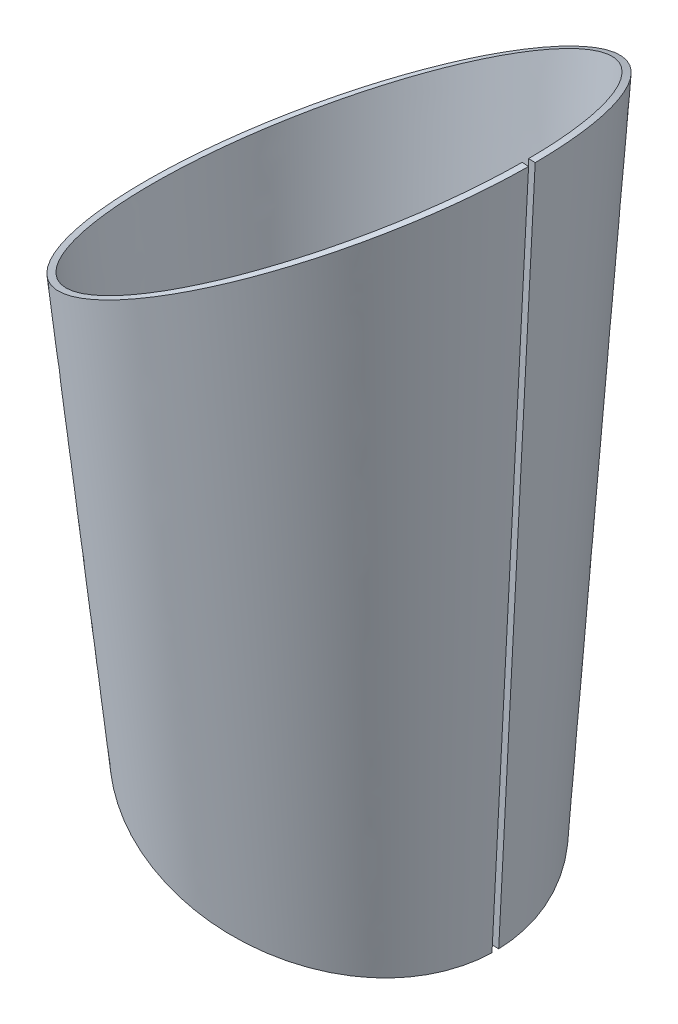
ISO-10303-21;
HEADER;
FILE_DESCRIPTION(('STEP AP214'),'2;1');
FILE_NAME('part.step','',(''),(''),'','','');
FILE_SCHEMA(('AUTOMOTIVE_DESIGN { 1 0 10303 214 1 1 1 1 }'));
ENDSEC;
DATA;
#1=APPLICATION_CONTEXT('core data for automotive mechanical design processes');
#2=APPLICATION_PROTOCOL_DEFINITION('international standard','automotive_design',2000,#1);
#3=PRODUCT_CONTEXT('',#1,'mechanical');
#4=PRODUCT('Part','Part','',(#3));
#5=PRODUCT_RELATED_PRODUCT_CATEGORY('part','',(#4));
#6=PRODUCT_DEFINITION_FORMATION('','',#4);
#7=PRODUCT_DEFINITION_CONTEXT('part definition',#1,'design');
#8=PRODUCT_DEFINITION('design','',#6,#7);
#9=PRODUCT_DEFINITION_SHAPE('','',#8);
#10=(LENGTH_UNIT() NAMED_UNIT(*) SI_UNIT(.MILLI.,.METRE.));
#11=(NAMED_UNIT(*) PLANE_ANGLE_UNIT() SI_UNIT($,.RADIAN.));
#12=(NAMED_UNIT(*) SI_UNIT($,.STERADIAN.) SOLID_ANGLE_UNIT());
#13=UNCERTAINTY_MEASURE_WITH_UNIT(LENGTH_MEASURE(1.E-05),#10,'distance_accuracy_value','');
#14=(GEOMETRIC_REPRESENTATION_CONTEXT(3) GLOBAL_UNCERTAINTY_ASSIGNED_CONTEXT((#13)) GLOBAL_UNIT_ASSIGNED_CONTEXT((#10,
#11,#12)) REPRESENTATION_CONTEXT('',''));
#15=CARTESIAN_POINT('',(0.,0.,0.));
#16=DIRECTION('',(0.,0.,1.));
#17=DIRECTION('',(1.,0.,0.));
#18=AXIS2_PLACEMENT_3D('',#15,#16,#17);
#19=CARTESIAN_POINT('',(14.9302857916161,49.4498078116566,-0.256418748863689));
#20=CARTESIAN_POINT('',(14.8687812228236,49.4164323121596,-4.89962809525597));
#21=CARTESIAN_POINT('',(13.1747422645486,48.4970121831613,-9.08992767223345));
#22=CARTESIAN_POINT('',(9.11277967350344,46.3049031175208,-13.6353972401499));
#23=CARTESIAN_POINT('',(7.50455396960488,45.4386921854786,-14.8608833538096));
#24=CARTESIAN_POINT('',(3.933050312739,43.5217069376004,-16.5488710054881));
#25=CARTESIAN_POINT('',(1.96910320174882,42.470965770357,-17.0106807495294));
#26=CARTESIAN_POINT('',(-2.14311954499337,40.2718441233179,-16.9827369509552));
#27=CARTESIAN_POINT('',(-4.10516676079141,39.2257627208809,-16.4942500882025));
#28=CARTESIAN_POINT('',(-7.66605333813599,37.325102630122,-14.7525920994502));
#29=CARTESIAN_POINT('',(-9.26515057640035,36.4704695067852,-13.5003353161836));
#30=CARTESIAN_POINT('',(-13.2846676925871,34.3190225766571,-8.88166121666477));
#31=CARTESIAN_POINT('',(-14.9302782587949,33.434502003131,-4.65256872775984));
#32=CARTESIAN_POINT('',(-14.9302782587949,33.434502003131,4.65256872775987));
#33=CARTESIAN_POINT('',(-13.2846676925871,34.3190225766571,8.8816612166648));
#34=CARTESIAN_POINT('',(-9.26515057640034,36.4704695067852,13.5003353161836));
#35=CARTESIAN_POINT('',(-7.66605333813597,37.325102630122,14.7525920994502));
#36=CARTESIAN_POINT('',(-4.10516676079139,39.2257627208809,16.4942500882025));
#37=CARTESIAN_POINT('',(-2.14311954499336,40.271844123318,16.9827369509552));
#38=CARTESIAN_POINT('',(1.96910320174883,42.470965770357,17.0106807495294));
#39=CARTESIAN_POINT('',(3.93305031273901,43.5217069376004,16.5488710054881));
#40=CARTESIAN_POINT('',(7.50455396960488,45.4386921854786,14.8608833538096));
#41=CARTESIAN_POINT('',(9.11277967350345,46.3049031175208,13.6353972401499));
#42=CARTESIAN_POINT('',(13.1747422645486,48.4970121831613,9.08992767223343));
#43=CARTESIAN_POINT('',(14.8687812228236,49.4164323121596,4.89962809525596));
#44=CARTESIAN_POINT('',(14.9302857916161,49.4498078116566,0.256418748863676));
#45=CARTESIAN_POINT('',(14.431008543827,49.47590258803,-0.24999282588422));
#46=CARTESIAN_POINT('',(14.3709868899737,49.4426461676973,-4.77846716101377));
#47=CARTESIAN_POINT('',(12.7166147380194,48.5260020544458,-8.85800586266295));
#48=CARTESIAN_POINT('',(8.77202869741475,46.3404106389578,-13.26626957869));
#49=CARTESIAN_POINT('',(7.21332871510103,45.4767759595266,-14.4505167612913));
#50=CARTESIAN_POINT('',(3.76300246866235,43.5650409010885,-16.0757228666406));
#51=CARTESIAN_POINT('',(1.87137620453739,42.5169405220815,-16.5166817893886));
#52=CARTESIAN_POINT('',(-2.09005294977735,40.3220167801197,-16.482371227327));
#53=CARTESIAN_POINT('',(-3.97561816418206,39.2772746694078,-16.0086974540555));
#54=CARTESIAN_POINT('',(-7.40400990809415,37.3776929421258,-14.3239136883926));
#55=CARTESIAN_POINT('',(-8.94683643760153,36.5228533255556,-13.1128036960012));
#56=CARTESIAN_POINT('',(-12.8325480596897,34.3698826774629,-8.63672053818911));
#57=CARTESIAN_POINT('',(-14.4326651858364,33.4832998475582,-4.52899419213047));
#58=CARTESIAN_POINT('',(-14.4326651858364,33.4832998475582,4.5289941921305));
#59=CARTESIAN_POINT('',(-12.8325480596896,34.3698826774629,8.63672053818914));
#60=CARTESIAN_POINT('',(-8.94683643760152,36.5228533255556,13.1128036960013));
#61=CARTESIAN_POINT('',(-7.40400990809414,37.3776929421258,14.3239136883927));
#62=CARTESIAN_POINT('',(-3.97561816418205,39.2772746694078,16.0086974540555));
#63=CARTESIAN_POINT('',(-2.09005294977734,40.3220167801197,16.482371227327));
#64=CARTESIAN_POINT('',(1.8713762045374,42.5169405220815,16.5166817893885));
#65=CARTESIAN_POINT('',(3.76300246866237,43.5650409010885,16.0757228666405));
#66=CARTESIAN_POINT('',(7.21332871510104,45.4767759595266,14.4505167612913));
#67=CARTESIAN_POINT('',(8.77202869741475,46.3404106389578,13.26626957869));
#68=CARTESIAN_POINT('',(12.7166147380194,48.5260020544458,8.85800586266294));
#69=CARTESIAN_POINT('',(14.3709868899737,49.4426461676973,4.77846716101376));
#70=CARTESIAN_POINT('',(14.431008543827,49.47590258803,0.249992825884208));
#71=B_SPLINE_SURFACE_WITH_KNOTS('',1,3,((#19,#20,#21,#22,#23,#24,#25,#26,#27,#28,#29,#30,#31,
#32,#33,#34,#35,#36,#37,#38,#39,#40,#41,#42,#43,#44),(#45,#46,#47,#48,#49,#50,#51,#52,#53,#54,
#55,#56,#57,#58,#59,#60,#61,#62,#63,#64,#65,#66,#67,#68,#69,#70)),.UNSPECIFIED.,.F.,.F.,.F.,(2,
2),(4,2,2,2,2,2,2,2,2,2,2,2,4),(0.,1.),(0.,0.125,0.1875,0.25,0.3125,0.375,0.5,0.625,0.6875,0.75,
0.8125,0.875,1.),.UNSPECIFIED.);
#72=CARTESIAN_POINT('',(14.431008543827,49.47590258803,0.249992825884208));
#73=CARTESIAN_POINT('',(14.9302857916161,49.4498078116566,0.256418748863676));
#74=B_SPLINE_CURVE_WITH_KNOTS('',1,(#72,#73),.UNSPECIFIED.,.F.,.F.,(2,2),(0.,1.),.UNSPECIFIED.);
#75=CARTESIAN_POINT('',(14.431008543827,49.47590258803,0.249992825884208));
#76=VERTEX_POINT('',#75);
#77=CARTESIAN_POINT('',(14.9302857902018,49.4498077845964,0.256418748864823));
#78=VERTEX_POINT('',#77);
#79=EDGE_CURVE('E14',#76,#78,#74,.T.);
#80=CARTESIAN_POINT('',(14.431008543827,49.47590258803,0.249992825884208));
#81=CARTESIAN_POINT('',(14.3709868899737,49.4426461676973,4.77846716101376));
#82=CARTESIAN_POINT('',(12.7166147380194,48.5260020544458,8.85800586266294));
#83=CARTESIAN_POINT('',(8.77202869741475,46.3404106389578,13.26626957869));
#84=CARTESIAN_POINT('',(7.21332871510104,45.4767759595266,14.4505167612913));
#85=CARTESIAN_POINT('',(3.76300246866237,43.5650409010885,16.0757228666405));
#86=CARTESIAN_POINT('',(1.8713762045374,42.5169405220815,16.5166817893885));
#87=CARTESIAN_POINT('',(-2.09005294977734,40.3220167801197,16.482371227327));
#88=CARTESIAN_POINT('',(-3.97561816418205,39.2772746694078,16.0086974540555));
#89=CARTESIAN_POINT('',(-7.40400990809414,37.3776929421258,14.3239136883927));
#90=CARTESIAN_POINT('',(-8.94683643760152,36.5228533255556,13.1128036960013));
#91=CARTESIAN_POINT('',(-12.8325480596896,34.3698826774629,8.63672053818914));
#92=CARTESIAN_POINT('',(-14.4326651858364,33.4832998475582,4.5289941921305));
#93=CARTESIAN_POINT('',(-14.4326651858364,33.4832998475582,-4.52899419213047));
#94=CARTESIAN_POINT('',(-12.8325480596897,34.3698826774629,-8.63672053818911));
#95=CARTESIAN_POINT('',(-8.94683643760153,36.5228533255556,-13.1128036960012));
#96=CARTESIAN_POINT('',(-7.40400990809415,37.3776929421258,-14.3239136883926));
#97=CARTESIAN_POINT('',(-3.97561816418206,39.2772746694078,-16.0086974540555));
#98=CARTESIAN_POINT('',(-2.09005294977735,40.3220167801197,-16.482371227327));
#99=CARTESIAN_POINT('',(1.87137620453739,42.5169405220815,-16.5166817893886));
#100=CARTESIAN_POINT('',(3.76300246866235,43.5650409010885,-16.0757228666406));
#101=CARTESIAN_POINT('',(7.21332871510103,45.4767759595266,-14.4505167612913));
#102=CARTESIAN_POINT('',(8.77202869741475,46.3404106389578,-13.26626957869));
#103=CARTESIAN_POINT('',(12.7166147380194,48.5260020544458,-8.85800586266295));
#104=CARTESIAN_POINT('',(14.3709868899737,49.4426461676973,-4.77846716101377));
#105=CARTESIAN_POINT('',(14.431008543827,49.47590258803,-0.24999282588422));
#106=B_SPLINE_CURVE_WITH_KNOTS('',3,(#80,#81,#82,#83,#84,#85,#86,#87,#88,#89,#90,#91,#92,#93,
#94,#95,#96,#97,#98,#99,#100,#101,#102,#103,#104,#105),.UNSPECIFIED.,.F.,.F.,(4,2,2,2,2,2,2,2,2,
2,2,2,4),(0.,0.125,0.1875,0.25,0.3125,0.375,0.5,0.625,0.6875,0.75,0.8125,0.875,1.),.UNSPECIFIED.);
#107=CARTESIAN_POINT('',(14.431008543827,49.47590258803,-0.24999282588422));
#108=VERTEX_POINT('',#107);
#109=EDGE_CURVE('E240',#76,#108,#106,.T.);
#110=CARTESIAN_POINT('',(14.431008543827,49.47590258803,-0.24999282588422));
#111=CARTESIAN_POINT('',(14.9302857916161,49.4498078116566,-0.256418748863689));
#112=B_SPLINE_CURVE_WITH_KNOTS('',1,(#110,#111),.UNSPECIFIED.,.F.,.F.,(2,2),(0.,1.),.UNSPECIFIED.);
#113=CARTESIAN_POINT('',(14.9302857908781,49.4498078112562,-0.256418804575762));
#114=VERTEX_POINT('',#113);
#115=EDGE_CURVE('E73',#108,#114,#112,.T.);
#116=CARTESIAN_POINT('',(14.9302857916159,49.4498078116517,0.256418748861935));
#117=CARTESIAN_POINT('',(14.926474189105,49.4477393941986,0.54499756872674));
#118=CARTESIAN_POINT('',(14.9163074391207,49.4422242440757,0.833472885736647));
#119=CARTESIAN_POINT('',(14.883384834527,49.4243696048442,1.40654364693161));
#120=CARTESIAN_POINT('',(14.8607581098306,49.4121001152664,1.69114870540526));
#121=CARTESIAN_POINT('',(14.8032229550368,49.3809067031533,2.25612345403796));
#122=CARTESIAN_POINT('',(14.7684282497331,49.3620443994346,2.53650811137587));
#123=CARTESIAN_POINT('',(14.6868805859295,49.3178436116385,3.09268613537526));
#124=CARTESIAN_POINT('',(14.640226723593,49.2925587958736,3.36849829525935));
#125=CARTESIAN_POINT('',(14.5352790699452,49.2356883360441,3.91517931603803));
#126=CARTESIAN_POINT('',(14.4770708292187,49.2041490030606,4.18606941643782));
#127=CARTESIAN_POINT('',(14.3493327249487,49.134944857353,4.72255673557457));
#128=CARTESIAN_POINT('',(14.2798759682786,49.0973196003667,4.98817646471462));
#129=CARTESIAN_POINT('',(14.1299573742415,49.0161181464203,5.51377587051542));
#130=CARTESIAN_POINT('',(14.0495573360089,48.9725753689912,5.7737783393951));
#131=CARTESIAN_POINT('',(13.8780671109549,48.8797128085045,6.28779801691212));
#132=CARTESIAN_POINT('',(13.7870285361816,48.8304209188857,6.54183748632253));
#133=CARTESIAN_POINT('',(13.5945742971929,48.7262334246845,7.04358755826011));
#134=CARTESIAN_POINT('',(13.4932011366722,48.6713607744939,7.29131923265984));
#135=CARTESIAN_POINT('',(13.2803888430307,48.5561844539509,7.78011130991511));
#136=CARTESIAN_POINT('',(13.1689841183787,48.495899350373,8.02119107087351));
#137=CARTESIAN_POINT('',(12.9364178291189,48.3700702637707,8.49633772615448));
#138=CARTESIAN_POINT('',(12.8152835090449,48.3045409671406,8.73042184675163));
#139=CARTESIAN_POINT('',(12.5635652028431,48.1683951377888,9.19123604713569));
#140=CARTESIAN_POINT('',(12.4330021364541,48.0977898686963,9.41798088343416));
#141=CARTESIAN_POINT('',(12.1627316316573,47.9516633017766,9.863775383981));
#142=CARTESIAN_POINT('',(12.0230395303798,47.8761502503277,10.0828370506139));
#143=CARTESIAN_POINT('',(11.7348145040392,47.7203789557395,10.5129237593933));
#144=CARTESIAN_POINT('',(11.5862919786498,47.6401262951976,10.7239577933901));
#145=CARTESIAN_POINT('',(11.2807080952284,47.4750463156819,11.1376471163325));
#146=CARTESIAN_POINT('',(11.1236527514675,47.3902222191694,11.3403081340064));
#147=CARTESIAN_POINT('',(10.801303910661,47.2161696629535,11.7369083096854));
#148=CARTESIAN_POINT('',(10.6360125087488,47.1269423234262,11.9308496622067));
#149=CARTESIAN_POINT('',(10.2974912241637,46.9442534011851,12.309666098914));
#150=CARTESIAN_POINT('',(10.1242599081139,46.8507910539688,12.4945395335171));
#151=CARTESIAN_POINT('',(9.7701578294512,46.6598021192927,12.8548741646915));
#152=CARTESIAN_POINT('',(9.58928243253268,46.5622730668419,13.0303295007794));
#153=CARTESIAN_POINT('',(9.22019102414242,46.3633206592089,13.3714801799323));
#154=CARTESIAN_POINT('',(9.03196745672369,46.2618932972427,13.537165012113));
#155=CARTESIAN_POINT('',(8.64847884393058,46.0553141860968,13.8584249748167));
#156=CARTESIAN_POINT('',(8.45320356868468,45.9501570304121,14.0139844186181));
#157=CARTESIAN_POINT('',(8.05591155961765,45.7362882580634,14.3146418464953));
#158=CARTESIAN_POINT('',(7.85388215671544,45.6275699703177,14.4597183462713));
#159=CARTESIAN_POINT('',(7.44338344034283,45.4067488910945,14.7390560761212));
#160=CARTESIAN_POINT('',(7.23489926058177,45.2946383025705,14.8732892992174));
#161=CARTESIAN_POINT('',(6.8117947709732,45.0672026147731,15.1305847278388));
#162=CARTESIAN_POINT('',(6.59715766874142,44.9518687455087,15.2536115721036));
#163=CARTESIAN_POINT('',(6.16205409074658,44.7181565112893,15.4881368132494));
#164=CARTESIAN_POINT('',(5.94156921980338,44.5997685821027,15.5995915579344));
#165=CARTESIAN_POINT('',(5.49508058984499,44.3601182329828,15.8106139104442));
#166=CARTESIAN_POINT('',(5.26905723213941,44.2388456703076,15.9101285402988));
#167=CARTESIAN_POINT('',(4.811806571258,43.9935959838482,16.0969113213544));
#168=CARTESIAN_POINT('',(4.58055896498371,43.8696084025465,16.1841160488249));
#169=CARTESIAN_POINT('',(4.11317982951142,43.6190984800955,16.3459198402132));
#170=CARTESIAN_POINT('',(3.87702791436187,43.4925656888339,16.4204438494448));
#171=CARTESIAN_POINT('',(3.40016582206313,43.2371347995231,16.5565281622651));
#172=CARTESIAN_POINT('',(3.15943594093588,43.1082266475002,16.6180005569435));
#173=CARTESIAN_POINT('',(2.6737492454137,42.8482144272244,16.7276259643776));
#174=CARTESIAN_POINT('',(2.42877433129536,42.717101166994,16.7756769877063));
#175=CARTESIAN_POINT('',(1.93493548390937,42.4528463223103,16.8581074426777));
#176=CARTESIAN_POINT('',(1.68605615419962,42.3196969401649,16.8923696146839));
#177=CARTESIAN_POINT('',(1.1847491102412,42.0515414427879,16.9468757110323));
#178=CARTESIAN_POINT('',(0.932309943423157,41.9165295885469,16.9669860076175));
#179=CARTESIAN_POINT('',(0.424239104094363,41.644801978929,16.9928457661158));
#180=CARTESIAN_POINT('',(0.168601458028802,41.508083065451,16.9984442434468));
#181=CARTESIAN_POINT('',(-0.342638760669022,41.234715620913,16.9949733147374));
#182=CARTESIAN_POINT('',(-0.598241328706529,41.0980670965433,16.9859027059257));
#183=CARTESIAN_POINT('',(-1.10617270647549,40.8266223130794,16.9531423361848));
#184=CARTESIAN_POINT('',(-1.35850851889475,40.6918212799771,16.9296010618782));
#185=CARTESIAN_POINT('',(-1.85953929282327,40.4242262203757,16.8682621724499));
#186=CARTESIAN_POINT('',(-2.10824651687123,40.2914250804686,16.8305958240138));
#187=CARTESIAN_POINT('',(-2.60166829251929,40.0280014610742,16.7413777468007));
#188=CARTESIAN_POINT('',(-2.84639886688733,39.8973700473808,16.6899410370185));
#189=CARTESIAN_POINT('',(-3.33151820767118,39.6384515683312,16.573557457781));
#190=CARTESIAN_POINT('',(-3.57192554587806,39.5101543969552,16.5087104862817));
#191=CARTESIAN_POINT('',(-4.04805625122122,39.2560703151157,16.3658854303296));
#192=CARTESIAN_POINT('',(-4.28379966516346,39.1302726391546,16.287993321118));
#193=CARTESIAN_POINT('',(-4.75026675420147,38.8813522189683,16.1194594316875));
#194=CARTESIAN_POINT('',(-4.98101104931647,38.7582184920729,16.0288909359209));
#195=CARTESIAN_POINT('',(-5.43715084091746,38.5147899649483,15.8353869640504));
#196=CARTESIAN_POINT('',(-5.66256678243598,38.3944843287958,15.7325133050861));
#197=CARTESIAN_POINT('',(-6.10772723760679,38.1568753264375,15.5147818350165));
#198=CARTESIAN_POINT('',(-6.32749141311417,38.039561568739,15.399975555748));
#199=CARTESIAN_POINT('',(-6.76103172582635,37.808099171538,15.1587608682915));
#200=CARTESIAN_POINT('',(-6.97482625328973,37.6939408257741,15.0323948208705));
#201=CARTESIAN_POINT('',(-7.39611608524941,37.4689517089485,14.7684410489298));
#202=CARTESIAN_POINT('',(-7.60362811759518,37.3581121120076,14.630887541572));
#203=CARTESIAN_POINT('',(-8.01204651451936,37.1399226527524,14.3449371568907));
#204=CARTESIAN_POINT('',(-8.21296762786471,37.0325650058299,14.1965672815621));
#205=CARTESIAN_POINT('',(-8.60790174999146,36.8215013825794,13.8893599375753));
#206=CARTESIAN_POINT('',(-8.80192726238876,36.7177888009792,13.730543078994));
#207=CARTESIAN_POINT('',(-9.18277102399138,36.5141770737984,13.4028148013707));
#208=CARTESIAN_POINT('',(-9.36959929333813,36.4142726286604,13.2339183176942));
#209=CARTESIAN_POINT('',(-9.73575199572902,36.2184388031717,12.886401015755));
#210=CARTESIAN_POINT('',(-9.91508373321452,36.1225055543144,12.7077900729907));
#211=CARTESIAN_POINT('',(-10.2659487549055,35.9347756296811,12.3412113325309));
#212=CARTESIAN_POINT('',(-10.4374863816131,35.8429766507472,12.1532488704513));
#213=CARTESIAN_POINT('',(-10.7724699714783,35.6636766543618,11.7683319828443));
#214=CARTESIAN_POINT('',(-10.9359170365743,35.5761750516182,11.5713787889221));
#215=CARTESIAN_POINT('',(-11.2544272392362,35.4056310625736,11.1688429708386));
#216=CARTESIAN_POINT('',(-11.4094879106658,35.3225899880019,10.9632578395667));
#217=CARTESIAN_POINT('',(-11.7109336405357,35.1611281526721,10.5438186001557));
#218=CARTESIAN_POINT('',(-11.8573122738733,35.0827108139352,10.3299585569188));
#219=CARTESIAN_POINT('',(-12.1411025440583,34.9306573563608,9.8943281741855));
#220=CARTESIAN_POINT('',(-12.2785033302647,34.8570270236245,9.67254874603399));
#221=CARTESIAN_POINT('',(-12.5440466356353,34.7147082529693,9.22143681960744));
#222=CARTESIAN_POINT('',(-12.6721733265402,34.64602826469,8.99209233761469));
#223=CARTESIAN_POINT('',(-12.9188771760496,34.5137705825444,8.52620639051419));
#224=CARTESIAN_POINT('',(-13.0374328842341,34.4502043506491,8.2896503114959));
#225=CARTESIAN_POINT('',(-13.2647034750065,34.3283342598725,7.80969641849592));
#226=CARTESIAN_POINT('',(-13.373390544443,34.2700452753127,7.56628165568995));
#227=CARTESIAN_POINT('',(-13.5806325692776,34.1588893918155,7.07296507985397));
#228=CARTESIAN_POINT('',(-13.6791525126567,34.106041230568,6.82304433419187));
#229=CARTESIAN_POINT('',(-13.8657690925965,34.0059262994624,6.31707015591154));
#230=CARTESIAN_POINT('',(-13.9538225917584,33.9586826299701,6.06099624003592));
#231=CARTESIAN_POINT('',(-14.119215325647,33.8699355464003,5.54306996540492));
#232=CARTESIAN_POINT('',(-14.1965022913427,33.828460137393,5.28119611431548));
#233=CARTESIAN_POINT('',(-14.3400714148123,33.751407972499,4.75202424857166));
#234=CARTESIAN_POINT('',(-14.4062911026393,33.7158647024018,4.48470440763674));
#235=CARTESIAN_POINT('',(-14.52743574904,33.6508347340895,3.9449949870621));
#236=CARTESIAN_POINT('',(-14.5822869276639,33.6213876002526,3.67258407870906));
#237=CARTESIAN_POINT('',(-14.6804054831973,33.5687073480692,3.12304712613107));
#238=CARTESIAN_POINT('',(-14.7235866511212,33.5455204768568,2.84590125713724));
#239=CARTESIAN_POINT('',(-14.7980771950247,33.5055177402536,2.28724923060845));
#240=CARTESIAN_POINT('',(-14.8292868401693,33.4887553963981,2.00572594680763));
#241=CARTESIAN_POINT('',(-14.8795476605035,33.4617582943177,1.43867385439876));
#242=CARTESIAN_POINT('',(-14.8984845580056,33.4515848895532,1.15313200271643));
#243=CARTESIAN_POINT('',(-14.923914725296,33.4379219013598,0.578398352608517));
#244=CARTESIAN_POINT('',(-14.9302782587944,33.4345020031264,0.289199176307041));
#245=CARTESIAN_POINT('',(-14.930278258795,33.4345020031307,-0.289199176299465));
#246=CARTESIAN_POINT('',(-14.923914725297,33.4379219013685,-0.578398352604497));
#247=CARTESIAN_POINT('',(-14.8984845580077,33.4515848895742,-1.15313200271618));
#248=CARTESIAN_POINT('',(-14.8795476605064,33.4617582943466,-1.43867385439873));
#249=CARTESIAN_POINT('',(-14.8292868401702,33.48875539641,-2.00572594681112));
#250=CARTESIAN_POINT('',(-14.7980771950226,33.5055177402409,-2.2872492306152));
#251=CARTESIAN_POINT('',(-14.7235866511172,33.5455204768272,-2.8459012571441));
#252=CARTESIAN_POINT('',(-14.6804054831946,33.5687073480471,-3.12304712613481));
#253=CARTESIAN_POINT('',(-14.5822869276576,33.6213876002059,-3.67258407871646));
#254=CARTESIAN_POINT('',(-14.5274357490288,33.6508347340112,-3.94499498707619));
#255=CARTESIAN_POINT('',(-14.4062911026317,33.7158647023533,-4.48470440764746));
#256=CARTESIAN_POINT('',(-14.3400714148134,33.7514079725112,-4.75202424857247));
#257=CARTESIAN_POINT('',(-14.1965022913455,33.8284601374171,-5.28119611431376));
#258=CARTESIAN_POINT('',(-14.1192153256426,33.8699355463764,-5.54306996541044));
#259=CARTESIAN_POINT('',(-13.9538225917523,33.9586826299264,-6.06099624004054));
#260=CARTESIAN_POINT('',(-13.865769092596,34.0059262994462,-6.31707015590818));
#261=CARTESIAN_POINT('',(-13.6791525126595,34.1060412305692,-6.82304433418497));
#262=CARTESIAN_POINT('',(-13.5806325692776,34.1588893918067,-7.07296507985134));
#263=CARTESIAN_POINT('',(-13.3733905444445,34.2700452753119,-7.56628165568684));
#264=CARTESIAN_POINT('',(-13.2647034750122,34.3283342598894,-7.80969641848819));
#265=CARTESIAN_POINT('',(-13.0374328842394,34.4502043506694,-8.28965031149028));
#266=CARTESIAN_POINT('',(-12.9188771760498,34.5137705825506,-8.52620639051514));
#267=CARTESIAN_POINT('',(-12.6721733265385,34.6460282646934,-8.99209233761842));
#268=CARTESIAN_POINT('',(-12.5440466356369,34.7147082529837,-9.22143681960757));
#269=CARTESIAN_POINT('',(-12.2785033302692,34.8570270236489,-9.67254874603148));
#270=CARTESIAN_POINT('',(-12.1411025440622,34.930657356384,-9.89432817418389));
#271=CARTESIAN_POINT('',(-11.8573122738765,35.0827108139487,-10.3299585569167));
#272=CARTESIAN_POINT('',(-11.710933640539,35.1611281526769,-10.5438186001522));
#273=CARTESIAN_POINT('',(-11.4094879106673,35.3225899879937,-10.9632578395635));
#274=CARTESIAN_POINT('',(-11.2544272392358,35.4056310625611,-11.1688429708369));
#275=CARTESIAN_POINT('',(-10.9359170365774,35.5761750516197,-11.571378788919));
#276=CARTESIAN_POINT('',(-10.7724699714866,35.6636766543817,-11.7683319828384));
#277=CARTESIAN_POINT('',(-10.4374863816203,35.8429766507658,-12.1532488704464));
#278=CARTESIAN_POINT('',(-10.2659487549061,35.9347756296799,-12.3412113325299));
#279=CARTESIAN_POINT('',(-9.91508373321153,36.1225055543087,-12.707790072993));
#280=CARTESIAN_POINT('',(-9.73575199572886,36.2184388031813,-12.8864010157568));
#281=CARTESIAN_POINT('',(-9.3695992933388,36.414272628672,-13.2339183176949));
#282=CARTESIAN_POINT('',(-9.18277102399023,36.5141770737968,-13.4028148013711));
#283=CARTESIAN_POINT('',(-8.8019272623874,36.7177888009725,-13.7305430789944));
#284=CARTESIAN_POINT('',(-8.60790174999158,36.8215013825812,-13.8893599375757));
#285=CARTESIAN_POINT('',(-8.21296762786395,37.0325650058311,-14.1965672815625));
#286=CARTESIAN_POINT('',(-8.01204651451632,37.1399226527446,-14.3449371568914));
#287=CARTESIAN_POINT('',(-7.60362811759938,37.3581121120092,-14.6308875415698));
#288=CARTESIAN_POINT('',(-7.39611608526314,37.4689517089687,-14.7684410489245));
#289=CARTESIAN_POINT('',(-6.97482625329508,37.6939408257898,-15.0323948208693));
#290=CARTESIAN_POINT('',(-6.76103172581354,37.8080991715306,-15.1587608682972));
#291=CARTESIAN_POINT('',(-6.32749141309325,38.0395615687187,-15.3999755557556));
#292=CARTESIAN_POINT('',(-6.10772723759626,38.1568753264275,-15.5147818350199));
#293=CARTESIAN_POINT('',(-5.66256678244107,38.394484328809,-15.7325133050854));
#294=CARTESIAN_POINT('',(-5.43715084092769,38.5147899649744,-15.8353869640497));
#295=CARTESIAN_POINT('',(-4.9810110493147,38.7582184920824,-16.0288909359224));
#296=CARTESIAN_POINT('',(-4.75026675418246,38.881352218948,-16.1194594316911));
#297=CARTESIAN_POINT('',(-4.28379966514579,39.1302726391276,-16.2879933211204));
#298=CARTESIAN_POINT('',(-4.04805625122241,39.2560703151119,-16.365885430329));
#299=CARTESIAN_POINT('',(-3.5719255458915,39.5101543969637,-16.5087104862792));
#300=CARTESIAN_POINT('',(-3.33151820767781,39.6384515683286,-16.5735574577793));
#301=CARTESIAN_POINT('',(-2.84639886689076,39.8973700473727,-16.6899410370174));
#302=CARTESIAN_POINT('',(-2.60166829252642,40.0280014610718,-16.7413777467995));
#303=CARTESIAN_POINT('',(-2.10824651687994,40.2914250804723,-16.8305958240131));
#304=CARTESIAN_POINT('',(-1.85953929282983,40.4242262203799,-16.8682621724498));
#305=CARTESIAN_POINT('',(-1.35850851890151,40.6918212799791,-16.929601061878));
#306=CARTESIAN_POINT('',(-1.10617270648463,40.8266223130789,-16.9531423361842));
#307=CARTESIAN_POINT('',(-0.59824132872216,41.0980670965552,-16.9859027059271));
#308=CARTESIAN_POINT('',(-0.34263876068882,41.2347156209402,-16.9949733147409));
#309=CARTESIAN_POINT('',(0.168601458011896,41.5080830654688,-16.9984442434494));
#310=CARTESIAN_POINT('',(0.424239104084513,41.6448019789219,-16.9928457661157));
#311=CARTESIAN_POINT('',(0.932309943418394,41.9165295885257,-16.9669860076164));
#312=CARTESIAN_POINT('',(1.18474911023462,42.051541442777,-16.9468757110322));
#313=CARTESIAN_POINT('',(1.68605615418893,42.3196969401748,-16.8923696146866));
#314=CARTESIAN_POINT('',(1.93493548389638,42.4528463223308,-16.8581074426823));
#315=CARTESIAN_POINT('',(2.42877433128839,42.7171011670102,-16.7756769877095));
#316=CARTESIAN_POINT('',(2.67374924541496,42.848214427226,-16.7276259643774));
#317=CARTESIAN_POINT('',(3.15943594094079,43.1082266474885,-16.618000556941));
#318=CARTESIAN_POINT('',(3.40016582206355,43.2371347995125,-16.5565281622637));
#319=CARTESIAN_POINT('',(3.8770279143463,43.492565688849,-16.4204438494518));
#320=CARTESIAN_POINT('',(4.11317982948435,43.6190984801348,-16.3459198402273));
#321=CARTESIAN_POINT('',(4.58055896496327,43.8696084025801,-16.1841160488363));
#322=CARTESIAN_POINT('',(4.81180657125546,43.993595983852,-16.0969113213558));
#323=CARTESIAN_POINT('',(5.26905723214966,44.2388456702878,-15.9101285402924));
#324=CARTESIAN_POINT('',(5.49508058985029,44.360118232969,-15.8106139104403));
#325=CARTESIAN_POINT('',(5.94156921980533,44.5997685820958,-15.5995915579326));
#326=CARTESIAN_POINT('',(6.16205409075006,44.7181565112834,-15.488136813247));
#327=CARTESIAN_POINT('',(6.59715766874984,44.9518687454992,-15.2536115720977));
#328=CARTESIAN_POINT('',(6.81179477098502,45.067202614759,-15.1305847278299));
#329=CARTESIAN_POINT('',(7.2348992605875,45.2946383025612,-14.8732892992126));
#330=CARTESIAN_POINT('',(7.44338344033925,45.4067488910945,-14.7390560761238));
#331=CARTESIAN_POINT('',(7.8538821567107,45.6275699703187,-14.459718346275));
#332=CARTESIAN_POINT('',(8.05591155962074,45.7362882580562,-14.3146418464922));
#333=CARTESIAN_POINT('',(8.45320356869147,45.9501570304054,-14.0139844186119));
#334=CARTESIAN_POINT('',(8.64847884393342,46.055314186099,-13.8584249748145));
#335=CARTESIAN_POINT('',(9.03196745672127,46.2618932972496,-13.5371650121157));
#336=CARTESIAN_POINT('',(9.22019102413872,46.3633206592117,-13.371480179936));
#337=CARTESIAN_POINT('',(9.58928243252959,46.5622730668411,-13.0303295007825));
#338=CARTESIAN_POINT('',(9.77015782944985,46.6598021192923,-12.8548741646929));
#339=CARTESIAN_POINT('',(10.1242599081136,46.8507910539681,-12.4945395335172));
#340=CARTESIAN_POINT('',(10.2974912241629,46.9442534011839,-12.3096660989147));
#341=CARTESIAN_POINT('',(10.6360125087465,47.1269423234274,-11.9308496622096));
#342=CARTESIAN_POINT('',(10.8013039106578,47.2161696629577,-11.73690830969));
#343=CARTESIAN_POINT('',(11.1236527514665,47.3902222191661,-11.3403081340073));
#344=CARTESIAN_POINT('',(11.2807080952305,47.4750463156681,-11.137647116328));
#345=CARTESIAN_POINT('',(11.5862919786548,47.640126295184,-10.7239577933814));
#346=CARTESIAN_POINT('',(11.734814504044,47.7203789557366,-10.5129237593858));
#347=CARTESIAN_POINT('',(12.023039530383,47.8761502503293,-10.0828370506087));
#348=CARTESIAN_POINT('',(12.1627316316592,47.9516633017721,-9.86377538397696));
#349=CARTESIAN_POINT('',(12.4330021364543,48.0977898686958,-9.41798088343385));
#350=CARTESIAN_POINT('',(12.5635652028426,48.1683951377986,-9.19123604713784));
#351=CARTESIAN_POINT('',(12.8152835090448,48.3045409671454,-8.73042184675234));
#352=CARTESIAN_POINT('',(12.9364178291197,48.3700702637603,-8.49633772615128));
#353=CARTESIAN_POINT('',(13.1689841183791,48.4958993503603,-8.02119107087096));
#354=CARTESIAN_POINT('',(13.2803888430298,48.5561844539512,-7.78011130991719));
#355=CARTESIAN_POINT('',(13.4932011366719,48.6713607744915,-7.29131923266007));
#356=CARTESIAN_POINT('',(13.5945742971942,48.7262334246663,-7.04358755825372));
#357=CARTESIAN_POINT('',(13.7870285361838,48.8304209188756,-6.54183748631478));
#358=CARTESIAN_POINT('',(13.8780671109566,48.8797128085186,-6.28779801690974));
#359=CARTESIAN_POINT('',(14.0495573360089,48.9725753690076,-5.77377833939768));
#360=CARTESIAN_POINT('',(14.1299573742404,49.0161181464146,-5.51377587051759));
#361=CARTESIAN_POINT('',(14.2798759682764,49.0973196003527,-4.98817646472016));
#362=CARTESIAN_POINT('',(14.3493327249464,49.1349448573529,-4.72255673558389));
#363=CARTESIAN_POINT('',(14.4770708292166,49.204149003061,-4.18606941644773));
#364=CARTESIAN_POINT('',(14.5352790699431,49.2356883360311,-3.91517931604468));
#365=CARTESIAN_POINT('',(14.6402267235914,49.292558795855,-3.36849829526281));
#366=CARTESIAN_POINT('',(14.6868805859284,49.3178436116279,-3.09268613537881));
#367=CARTESIAN_POINT('',(14.7684282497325,49.3620443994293,-2.53650811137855));
#368=CARTESIAN_POINT('',(14.8032229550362,49.3809067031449,-2.25612345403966));
#369=CARTESIAN_POINT('',(14.8607581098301,49.4121001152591,-1.69114870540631));
#370=CARTESIAN_POINT('',(14.8833848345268,49.4243696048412,-1.40654364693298));
#371=CARTESIAN_POINT('',(14.9163074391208,49.4422242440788,-0.833472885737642));
#372=CARTESIAN_POINT('',(14.9264741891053,49.4477393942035,-0.544997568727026));
#373=CARTESIAN_POINT('',(14.9302857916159,49.4498078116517,-0.256418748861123));
#374=B_SPLINE_CURVE_WITH_KNOTS('',3,(#116,#117,#118,#119,#120,#121,#122,#123,#124,#125,#126,
#127,#128,#129,#130,#131,#132,#133,#134,#135,#136,#137,#138,#139,#140,#141,#142,#143,#144,#145,
#146,#147,#148,#149,#150,#151,#152,#153,#154,#155,#156,#157,#158,#159,#160,#161,#162,#163,#164,
#165,#166,#167,#168,#169,#170,#171,#172,#173,#174,#175,#176,#177,#178,#179,#180,#181,#182,#183,
#184,#185,#186,#187,#188,#189,#190,#191,#192,#193,#194,#195,#196,#197,#198,#199,#200,#201,#202,
#203,#204,#205,#206,#207,#208,#209,#210,#211,#212,#213,#214,#215,#216,#217,#218,#219,#220,#221,
#222,#223,#224,#225,#226,#227,#228,#229,#230,#231,#232,#233,#234,#235,#236,#237,#238,#239,#240,
#241,#242,#243,#244,#245,#246,#247,#248,#249,#250,#251,#252,#253,#254,#255,#256,#257,#258,#259,
#260,#261,#262,#263,#264,#265,#266,#267,#268,#269,#270,#271,#272,#273,#274,#275,#276,#277,#278,
#279,#280,#281,#282,#283,#284,#285,#286,#287,#288,#289,#290,#291,#292,#293,#294,#295,#296,#297,
#298,#299,#300,#301,#302,#303,#304,#305,#306,#307,#308,#309,#310,#311,#312,#313,#314,#315,#316,
#317,#318,#319,#320,#321,#322,#323,#324,#325,#326,#327,#328,#329,#330,#331,#332,#333,#334,#335,
#336,#337,#338,#339,#340,#341,#342,#343,#344,#345,#346,#347,#348,#349,#350,#351,#352,#353,#354,
#355,#356,#357,#358,#359,#360,#361,#362,#363,#364,#365,#366,#367,#368,#369,#370,#371,#372,#373),
.UNSPECIFIED.,.F.,.F.,(4,2,2,2,2,2,2,2,2,2,2,2,2,2,2,2,2,2,2,2,2,2,2,2,2,2,2,2,2,2,2,2,2,2,2,2,
2,2,2,2,2,2,2,2,2,2,2,2,2,2,2,2,2,2,2,2,2,2,2,2,2,2,2,2,2,2,2,2,2,2,2,2,2,2,2,2,2,2,2,2,2,2,2,2,
2,2,2,2,2,2,2,2,2,2,2,2,2,2,2,2,2,2,2,2,2,2,2,2,2,2,2,2,2,2,2,2,2,2,2,2,2,2,2,2,2,2,2,2,4),(0.,
0.865751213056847,1.72269454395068,2.57183377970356,3.41409828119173,4.25034469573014,
5.08135950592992,5.90786235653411,6.7305100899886,7.54990141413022,8.3665821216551,
9.18105078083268,9.99376481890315,10.8051469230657,11.6155916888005,12.4254724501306,
13.2351482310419,14.0449707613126,14.8552915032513,15.6664686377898,16.4788739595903,
17.2928996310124,18.1089647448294,18.9275216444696,19.7490619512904,20.5741222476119,
21.4032893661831,22.2372052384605,23.0765712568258,23.9221521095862,24.7747790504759,
25.6353525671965,26.5048444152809,27.3744075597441,28.2351935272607,29.0881706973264,
29.9342342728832,30.7742086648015,31.6088505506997,32.4388525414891,33.2648473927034,
34.087412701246,34.9070760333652,35.7243204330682,36.5395902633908,37.3532973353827,
38.1658272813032,38.9775461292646,39.788807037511,40.5999571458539,41.4113445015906,
42.2233250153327,43.0362693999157,43.850570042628,44.6666477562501,45.4849583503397,
46.305998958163,47.1303140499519,47.9585010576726,48.7912155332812,49.6291757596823,
50.4731667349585,51.3240434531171,52.1827334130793,53.0502382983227,53.9177431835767,
54.7764331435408,55.6273098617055,56.4713008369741,57.3092610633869,58.1419755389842,
58.9701625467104,59.7944776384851,60.6155182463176,61.433828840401,62.2499065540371,
63.0642071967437,63.877151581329,64.6891320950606,65.5005194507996,66.3116695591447,
67.1229304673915,67.9346493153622,68.7471792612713,69.5608863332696,70.3761561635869,
71.1934005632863,72.0130638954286,72.8356292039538,73.6616240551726,74.4916260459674,
75.3262679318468,76.1662423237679,77.012305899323,77.8652830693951,78.7260690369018,
79.5956321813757,80.4651240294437,81.3256975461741,82.1783244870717,83.0239053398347,
83.8632713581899,84.697187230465,85.5263543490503,86.3514146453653,87.1729549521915,
87.9915118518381,88.8075769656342,89.6216026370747,90.4340079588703,91.2451850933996,
92.0555058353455,92.8653283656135,93.6750041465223,94.4848849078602,95.2953296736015,
96.1067117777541,96.9194258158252,97.7338944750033,98.5505751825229,99.369966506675,
100.192614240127,101.019117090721,101.850131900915,102.686378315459,103.528642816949,
104.377782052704,105.234725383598,106.100476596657),.UNSPECIFIED.);
#375=EDGE_CURVE('E126',#78,#114,#374,.T.);
#376=ORIENTED_EDGE('',*,*,#79,.F.);
#377=ORIENTED_EDGE('',*,*,#109,.T.);
#378=ORIENTED_EDGE('',*,*,#115,.T.);
#379=ORIENTED_EDGE('',*,*,#375,.F.);
#380=EDGE_LOOP('',(#376,#377,#378,#379));
#381=FACE_BOUND('',#380,.T.);
#382=ADVANCED_FACE('F59',(#381),#71,.F.);
#383=CARTESIAN_POINT('',(14.9302857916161,49.4498078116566,-0.256418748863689));
#384=CARTESIAN_POINT('',(13.9874055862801,31.409656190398,-0.257183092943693));
#385=CARTESIAN_POINT('',(13.0445221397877,13.3695047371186,-0.258114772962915));
#386=CARTESIAN_POINT('',(12.1016264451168,-4.67064607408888,-0.259452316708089));
#387=CARTESIAN_POINT('',(14.431008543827,49.47590258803,-0.24999282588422));
#388=CARTESIAN_POINT('',(13.4881381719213,31.435750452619,-0.249991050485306));
#389=CARTESIAN_POINT('',(12.5452678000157,13.3955983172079,-0.249989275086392));
#390=CARTESIAN_POINT('',(11.6023974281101,-4.64455381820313,-0.249987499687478));
#391=B_SPLINE_SURFACE_WITH_KNOTS('',1,3,((#383,#384,#385,#386),(#387,#388,#389,#390)),
.UNSPECIFIED.,.F.,.F.,.F.,(2,2),(4,4),(0.,1.),(-0.0270971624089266,0.0270971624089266),.UNSPECIFIED.);
#392=CARTESIAN_POINT('',(14.431008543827,49.47590258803,-0.24999282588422));
#393=CARTESIAN_POINT('',(13.4881381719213,31.435750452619,-0.249991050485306));
#394=CARTESIAN_POINT('',(12.5452678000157,13.3955983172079,-0.249989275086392));
#395=CARTESIAN_POINT('',(11.6023974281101,-4.64455381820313,-0.249987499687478));
#396=B_SPLINE_CURVE_WITH_KNOTS('',3,(#392,#393,#394,#395),.UNSPECIFIED.,.F.,.F.,(4,4),
(-0.0270971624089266,0.0270971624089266),.UNSPECIFIED.);
#397=CARTESIAN_POINT('',(11.6023974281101,-4.64455381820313,-0.249987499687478));
#398=VERTEX_POINT('',#397);
#399=EDGE_CURVE('E109',#108,#398,#396,.T.);
#400=CARTESIAN_POINT('',(11.6023974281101,-4.64455381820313,-0.249987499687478));
#401=CARTESIAN_POINT('',(12.1016264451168,-4.67064607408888,-0.259452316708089));
#402=B_SPLINE_CURVE_WITH_KNOTS('',1,(#400,#401),.UNSPECIFIED.,.F.,.F.,(2,2),(0.,1.),.UNSPECIFIED.);
#403=CARTESIAN_POINT('',(12.1016264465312,-4.67064604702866,-0.259452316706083));
#404=VERTEX_POINT('',#403);
#405=EDGE_CURVE('E103',#398,#404,#402,.T.);
#406=CARTESIAN_POINT('',(14.9302857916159,49.4498078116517,-0.256418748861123));
#407=CARTESIAN_POINT('',(14.8124257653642,47.1947888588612,-0.256514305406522));
#408=CARTESIAN_POINT('',(14.6945656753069,44.9397699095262,-0.25661275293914));
#409=CARTESIAN_POINT('',(14.4588453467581,40.4297320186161,-0.256816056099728));
#410=CARTESIAN_POINT('',(14.3409851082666,38.1747130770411,-0.256920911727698));
#411=CARTESIAN_POINT('',(14.1052644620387,33.6646752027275,-0.257137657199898));
#412=CARTESIAN_POINT('',(13.9874040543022,31.409656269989,-0.257249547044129));
#413=CARTESIAN_POINT('',(13.7516830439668,26.8996184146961,-0.257481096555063));
#414=CARTESIAN_POINT('',(13.6338224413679,24.6445994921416,-0.257600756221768));
#415=CARTESIAN_POINT('',(13.3981010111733,20.1345616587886,-0.257848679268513));
#416=CARTESIAN_POINT('',(13.2802401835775,17.87954274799,-0.257976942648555));
#417=CARTESIAN_POINT('',(13.0445182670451,13.3695049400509,-0.258243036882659));
#418=CARTESIAN_POINT('',(12.9266571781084,11.1144860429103,-0.258380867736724));
#419=CARTESIAN_POINT('',(12.6909346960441,6.60444826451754,-0.258667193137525));
#420=CARTESIAN_POINT('',(12.5730733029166,4.34942938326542,-0.258815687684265));
#421=CARTESIAN_POINT('',(12.3373501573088,-0.160608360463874,-0.259124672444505));
#422=CARTESIAN_POINT('',(12.2194884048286,-2.41562722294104,-0.259285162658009));
#423=CARTESIAN_POINT('',(12.1016264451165,-4.67064607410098,-0.259452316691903));
#424=B_SPLINE_CURVE_WITH_KNOTS('',3,(#406,#407,#408,#409,#410,#411,#412,#413,#414,#415,#416,
#417,#418,#419,#420,#421,#422,#423),.UNSPECIFIED.,.F.,.F.,(4,2,2,2,2,2,2,2,4),(0.,
6.77429060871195,13.5485812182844,20.3228718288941,27.0971624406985,33.8714530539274,
40.6457436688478,47.420034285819,54.1943249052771),.UNSPECIFIED.);
#425=EDGE_CURVE('E107',#114,#404,#424,.T.);
#426=ORIENTED_EDGE('',*,*,#115,.F.);
#427=ORIENTED_EDGE('',*,*,#399,.T.);
#428=ORIENTED_EDGE('',*,*,#405,.T.);
#429=ORIENTED_EDGE('',*,*,#425,.F.);
#430=EDGE_LOOP('',(#426,#427,#428,#429));
#431=FACE_BOUND('',#430,.T.);
#432=ADVANCED_FACE('F106',(#431),#391,.T.);
#433=CARTESIAN_POINT('',(12.1016264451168,-4.67064607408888,-0.259452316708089));
#434=CARTESIAN_POINT('',(12.0355989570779,-4.64531097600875,-3.81196556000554));
#435=CARTESIAN_POINT('',(10.6445572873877,-4.11213413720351,-7.01372260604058));
#436=CARTESIAN_POINT('',(7.32897507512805,-2.84666162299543,-10.4735731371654));
#437=CARTESIAN_POINT('',(6.01838088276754,-2.34721463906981,-11.4033087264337));
#438=CARTESIAN_POINT('',(3.11494760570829,-1.24198696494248,-12.6755504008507));
#439=CARTESIAN_POINT('',(1.52189412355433,-0.636162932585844,-13.0173549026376));
#440=CARTESIAN_POINT('',(-1.80317207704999,0.632960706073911,-12.9755497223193));
#441=CARTESIAN_POINT('',(-3.38599765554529,1.23749088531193,-12.5938289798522));
#442=CARTESIAN_POINT('',(-6.25525987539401,2.3375259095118,-11.2531449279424));
#443=CARTESIAN_POINT('',(-7.54222999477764,2.83299309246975,-10.2947369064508));
#444=CARTESIAN_POINT('',(-9.69898499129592,3.6653512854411,-7.94335247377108));
#445=CARTESIAN_POINT('',(-10.5691051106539,4.0022433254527,-6.55011402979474));
#446=CARTESIAN_POINT('',(-11.7708699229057,4.46792049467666,-3.46469568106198));
#447=CARTESIAN_POINT('',(-12.102331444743,4.59668507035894,-1.77224610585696));
#448=CARTESIAN_POINT('',(-12.102331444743,4.59668507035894,1.77224610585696));
#449=CARTESIAN_POINT('',(-11.7708699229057,4.46792049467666,3.46469568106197));
#450=CARTESIAN_POINT('',(-10.5691051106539,4.0022433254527,6.55011402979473));
#451=CARTESIAN_POINT('',(-9.69898499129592,3.6653512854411,7.94335247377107));
#452=CARTESIAN_POINT('',(-7.54222999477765,2.83299309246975,10.2947369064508));
#453=CARTESIAN_POINT('',(-6.25525987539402,2.3375259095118,11.2531449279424));
#454=CARTESIAN_POINT('',(-3.3859976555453,1.23749088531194,12.5938289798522));
#455=CARTESIAN_POINT('',(-1.80317207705,0.632960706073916,12.9755497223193));
#456=CARTESIAN_POINT('',(1.52189412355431,-0.636162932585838,13.0173549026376));
#457=CARTESIAN_POINT('',(3.11494760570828,-1.24198696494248,12.6755504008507));
#458=CARTESIAN_POINT('',(6.01838088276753,-2.34721463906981,11.4033087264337));
#459=CARTESIAN_POINT('',(7.32897507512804,-2.84666162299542,10.4735731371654));
#460=CARTESIAN_POINT('',(10.6445572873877,-4.11213413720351,7.01372260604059));
#461=CARTESIAN_POINT('',(12.0355989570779,-4.64531097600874,3.81196556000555));
#462=CARTESIAN_POINT('',(12.1016264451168,-4.67064607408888,0.259452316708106));
#463=CARTESIAN_POINT('',(11.6023974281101,-4.64455381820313,-0.249987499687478));
#464=CARTESIAN_POINT('',(11.5388036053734,-4.61909658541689,-3.67447190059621));
#465=CARTESIAN_POINT('',(10.1990380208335,-4.08277524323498,-6.75394461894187));
#466=CARTESIAN_POINT('',(7.02085315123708,-2.81051657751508,-10.0761276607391));
#467=CARTESIAN_POINT('',(5.76670211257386,-2.30846758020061,-10.9673510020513));
#468=CARTESIAN_POINT('',(2.99317472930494,-1.19819728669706,-12.1875375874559));
#469=CARTESIAN_POINT('',(1.47379838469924,-0.589975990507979,-12.5165008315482));
#470=CARTESIAN_POINT('',(-1.70589275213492,0.682885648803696,-12.4822491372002));
#471=CARTESIAN_POINT('',(-3.21885748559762,1.288540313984,-12.1206214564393));
#472=CARTESIAN_POINT('',(-5.9691754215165,2.38951963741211,-10.8409319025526));
#473=CARTESIAN_POINT('',(-7.20652862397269,2.88484429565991,-9.92287002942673));
#474=CARTESIAN_POINT('',(-9.2837736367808,3.71638590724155,-7.66288156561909));
#475=CARTESIAN_POINT('',(-10.1236654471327,4.05260286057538,-6.32095497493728));
#476=CARTESIAN_POINT('',(-11.2841378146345,4.51715136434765,-3.34580655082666));
#477=CARTESIAN_POINT('',(-11.6047183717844,4.64548291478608,-1.71258471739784));
#478=CARTESIAN_POINT('',(-11.6047183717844,4.64548291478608,1.71258471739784));
#479=CARTESIAN_POINT('',(-11.2841378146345,4.51715136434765,3.34580655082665));
#480=CARTESIAN_POINT('',(-10.1236654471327,4.05260286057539,6.32095497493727));
#481=CARTESIAN_POINT('',(-9.2837736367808,3.71638590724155,7.66288156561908));
#482=CARTESIAN_POINT('',(-7.2065286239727,2.88484429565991,9.92287002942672));
#483=CARTESIAN_POINT('',(-5.96917542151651,2.38951963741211,10.8409319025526));
#484=CARTESIAN_POINT('',(-3.21885748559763,1.28854031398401,12.1206214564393));
#485=CARTESIAN_POINT('',(-1.70589275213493,0.682885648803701,12.4822491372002));
#486=CARTESIAN_POINT('',(1.47379838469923,-0.589975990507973,12.5165008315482));
#487=CARTESIAN_POINT('',(2.99317472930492,-1.19819728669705,12.1875375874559));
#488=CARTESIAN_POINT('',(5.76670211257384,-2.3084675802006,10.9673510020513));
#489=CARTESIAN_POINT('',(7.02085315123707,-2.81051657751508,10.0761276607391));
#490=CARTESIAN_POINT('',(10.1990380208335,-4.08277524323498,6.75394461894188));
#491=CARTESIAN_POINT('',(11.5388036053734,-4.61909658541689,3.67447190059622));
#492=CARTESIAN_POINT('',(11.6023974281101,-4.64455381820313,0.249987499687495));
#493=B_SPLINE_SURFACE_WITH_KNOTS('',1,3,((#433,#434,#435,#436,#437,#438,#439,#440,#441,#442,
#443,#444,#445,#446,#447,#448,#449,#450,#451,#452,#453,#454,#455,#456,#457,#458,#459,#460,#461,
#462),(#463,#464,#465,#466,#467,#468,#469,#470,#471,#472,#473,#474,#475,#476,#477,#478,#479,
#480,#481,#482,#483,#484,#485,#486,#487,#488,#489,#490,#491,#492)),.UNSPECIFIED.,.F.,.F.,.F.,(2,
2),(4,2,2,2,2,2,2,2,2,2,2,2,2,2,4),(0.,1.),(0.,0.125,0.1875,0.25,0.3125,0.375,0.4375,0.5,0.5625,
0.625,0.6875,0.75,0.8125,0.875,1.),.UNSPECIFIED.);
#494=CARTESIAN_POINT('',(11.6023974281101,-4.64455381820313,-0.249987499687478));
#495=CARTESIAN_POINT('',(11.5388036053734,-4.61909658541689,-3.67447190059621));
#496=CARTESIAN_POINT('',(10.1990380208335,-4.08277524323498,-6.75394461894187));
#497=CARTESIAN_POINT('',(7.02085315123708,-2.81051657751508,-10.0761276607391));
#498=CARTESIAN_POINT('',(5.76670211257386,-2.30846758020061,-10.9673510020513));
#499=CARTESIAN_POINT('',(2.99317472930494,-1.19819728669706,-12.1875375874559));
#500=CARTESIAN_POINT('',(1.47379838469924,-0.589975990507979,-12.5165008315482));
#501=CARTESIAN_POINT('',(-1.70589275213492,0.682885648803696,-12.4822491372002));
#502=CARTESIAN_POINT('',(-3.21885748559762,1.288540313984,-12.1206214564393));
#503=CARTESIAN_POINT('',(-5.9691754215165,2.38951963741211,-10.8409319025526));
#504=CARTESIAN_POINT('',(-7.20652862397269,2.88484429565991,-9.92287002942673));
#505=CARTESIAN_POINT('',(-9.2837736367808,3.71638590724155,-7.66288156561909));
#506=CARTESIAN_POINT('',(-10.1236654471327,4.05260286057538,-6.32095497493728));
#507=CARTESIAN_POINT('',(-11.2841378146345,4.51715136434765,-3.34580655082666));
#508=CARTESIAN_POINT('',(-11.6047183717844,4.64548291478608,-1.71258471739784));
#509=CARTESIAN_POINT('',(-11.6047183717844,4.64548291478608,1.71258471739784));
#510=CARTESIAN_POINT('',(-11.2841378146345,4.51715136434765,3.34580655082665));
#511=CARTESIAN_POINT('',(-10.1236654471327,4.05260286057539,6.32095497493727));
#512=CARTESIAN_POINT('',(-9.2837736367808,3.71638590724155,7.66288156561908));
#513=CARTESIAN_POINT('',(-7.2065286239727,2.88484429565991,9.92287002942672));
#514=CARTESIAN_POINT('',(-5.96917542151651,2.38951963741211,10.8409319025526));
#515=CARTESIAN_POINT('',(-3.21885748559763,1.28854031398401,12.1206214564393));
#516=CARTESIAN_POINT('',(-1.70589275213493,0.682885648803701,12.4822491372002));
#517=CARTESIAN_POINT('',(1.47379838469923,-0.589975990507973,12.5165008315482));
#518=CARTESIAN_POINT('',(2.99317472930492,-1.19819728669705,12.1875375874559));
#519=CARTESIAN_POINT('',(5.76670211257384,-2.3084675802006,10.9673510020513));
#520=CARTESIAN_POINT('',(7.02085315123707,-2.81051657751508,10.0761276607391));
#521=CARTESIAN_POINT('',(10.1990380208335,-4.08277524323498,6.75394461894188));
#522=CARTESIAN_POINT('',(11.5388036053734,-4.61909658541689,3.67447190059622));
#523=CARTESIAN_POINT('',(11.6023974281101,-4.64455381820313,0.249987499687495));
#524=B_SPLINE_CURVE_WITH_KNOTS('',3,(#494,#495,#496,#497,#498,#499,#500,#501,#502,#503,#504,
#505,#506,#507,#508,#509,#510,#511,#512,#513,#514,#515,#516,#517,#518,#519,#520,#521,#522,#523),
.UNSPECIFIED.,.F.,.F.,(4,2,2,2,2,2,2,2,2,2,2,2,2,2,4),(0.,0.125,0.1875,0.25,0.3125,0.375,0.4375,
0.5,0.5625,0.625,0.6875,0.75,0.8125,0.875,1.),.UNSPECIFIED.);
#525=CARTESIAN_POINT('',(11.6023974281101,-4.64455381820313,0.249987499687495));
#526=VERTEX_POINT('',#525);
#527=EDGE_CURVE('E128',#398,#526,#524,.T.);
#528=CARTESIAN_POINT('',(11.6023974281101,-4.64455381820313,0.249987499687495));
#529=CARTESIAN_POINT('',(12.1016264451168,-4.67064607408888,0.259452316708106));
#530=B_SPLINE_CURVE_WITH_KNOTS('',1,(#528,#529),.UNSPECIFIED.,.F.,.F.,(2,2),(0.,1.),.UNSPECIFIED.);
#531=CARTESIAN_POINT('',(12.1016264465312,-4.67064604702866,0.2594523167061));
#532=VERTEX_POINT('',#531);
#533=EDGE_CURVE('E116',#526,#532,#530,.T.);
#534=CARTESIAN_POINT('',(12.1016264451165,-4.67064607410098,-0.259452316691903));
#535=CARTESIAN_POINT('',(12.0975317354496,-4.66907482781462,-0.480235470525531));
#536=CARTESIAN_POINT('',(12.0882768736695,-4.66552562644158,-0.700912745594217));
#537=CARTESIAN_POINT('',(12.0595568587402,-4.65451599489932,-1.13927551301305));
#538=CARTESIAN_POINT('',(12.0401951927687,-4.64709520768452,-1.35696879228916));
#539=CARTESIAN_POINT('',(11.9915099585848,-4.6284399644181,-1.78908606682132));
#540=CARTESIAN_POINT('',(11.962277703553,-4.61724046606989,-2.00352184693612));
#541=CARTESIAN_POINT('',(11.8941133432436,-4.59113001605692,-2.42884692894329));
#542=CARTESIAN_POINT('',(11.8552609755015,-4.5762495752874,-2.63975088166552));
#543=CARTESIAN_POINT('',(11.768114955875,-4.54287783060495,-3.05773867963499));
#544=CARTESIAN_POINT('',(11.719890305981,-4.52441291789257,-3.26483901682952));
#545=CARTESIAN_POINT('',(11.6142587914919,-4.48397281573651,-3.67494842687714));
#546=CARTESIAN_POINT('',(11.5569110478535,-4.462020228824,-3.87797495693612));
#547=CARTESIAN_POINT('',(11.4332914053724,-4.41470491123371,-4.27966803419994));
#548=CARTESIAN_POINT('',(11.3670696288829,-4.38936133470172,-4.47835226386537));
#549=CARTESIAN_POINT('',(11.2259590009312,-4.33536382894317,-4.87109407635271));
#550=CARTESIAN_POINT('',(11.1511121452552,-4.30672594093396,-5.06516895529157));
#551=CARTESIAN_POINT('',(10.993007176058,-4.24623923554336,-5.44842711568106));
#552=CARTESIAN_POINT('',(10.9097837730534,-4.21440366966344,-5.63762680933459));
#553=CARTESIAN_POINT('',(10.735180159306,-4.14762068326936,-6.01087097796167));
#554=CARTESIAN_POINT('',(10.6438281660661,-4.11268402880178,-6.19493058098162));
#555=CARTESIAN_POINT('',(10.45322039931,-4.03979760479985,-6.55763188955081));
#556=CARTESIAN_POINT('',(10.3539870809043,-4.00185639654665,-6.73628711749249));
#557=CARTESIAN_POINT('',(10.1478682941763,-3.92305928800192,-7.0879175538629));
#558=CARTESIAN_POINT('',(10.0410001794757,-3.88220999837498,-7.26090441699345));
#559=CARTESIAN_POINT('',(9.81986212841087,-3.79769485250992,-7.60093618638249));
#560=CARTESIAN_POINT('',(9.705605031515,-3.75403388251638,-7.76799065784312));
#561=CARTESIAN_POINT('',(9.46993820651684,-3.66399322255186,-8.09589554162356));
#562=CARTESIAN_POINT('',(9.34853731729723,-3.61761689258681,-8.25675322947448));
#563=CARTESIAN_POINT('',(9.09883119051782,-3.52224309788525,-8.57200196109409));
#564=CARTESIAN_POINT('',(8.97053123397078,-3.47324763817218,-8.72639779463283));
#565=CARTESIAN_POINT('',(8.70727464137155,-3.37273292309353,-9.02845947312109));
#566=CARTESIAN_POINT('',(8.57232010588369,-3.32121446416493,-9.1761274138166));
#567=CARTESIAN_POINT('',(8.29600176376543,-3.21575085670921,-9.4644689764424));
#568=CARTESIAN_POINT('',(8.15463719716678,-3.16180542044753,-9.60514176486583));
#569=CARTESIAN_POINT('',(7.8657463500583,-3.0515847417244,-9.87922754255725));
#570=CARTESIAN_POINT('',(7.71821672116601,-2.99530823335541,-10.0126364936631));
#571=CARTESIAN_POINT('',(7.41724391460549,-2.88052207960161,-10.2719278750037));
#572=CARTESIAN_POINT('',(7.26379503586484,-2.82201028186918,-10.3978027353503));
#573=CARTESIAN_POINT('',(6.95123300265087,-2.70285001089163,-10.6417579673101));
#574=CARTESIAN_POINT('',(6.7921120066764,-2.64219858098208,-10.7598268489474));
#575=CARTESIAN_POINT('',(6.46845664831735,-2.51885530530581,-10.9879010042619));
#576=CARTESIAN_POINT('',(6.30391250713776,-2.45615977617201,-11.0978904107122));
#577=CARTESIAN_POINT('',(5.96966394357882,-2.32882436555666,-11.3095355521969));
#578=CARTESIAN_POINT('',(5.79994801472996,-2.26418015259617,-11.4111705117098));
#579=CARTESIAN_POINT('',(5.45561166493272,-2.13304324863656,-11.6058360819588));
#580=CARTESIAN_POINT('',(5.28097824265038,-2.06654566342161,-11.698840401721));
#581=CARTESIAN_POINT('',(4.92706588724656,-1.93179770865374,-11.8759738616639));
#582=CARTESIAN_POINT('',(4.74777273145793,-1.86354198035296,-11.9600705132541));
#583=CARTESIAN_POINT('',(4.38480349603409,-1.72537326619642,-12.1191182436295));
#584=CARTESIAN_POINT('',(4.20111230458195,-1.65545457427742,-12.1940298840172));
#585=CARTESIAN_POINT('',(3.82961349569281,-1.51405530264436,-12.3344383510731));
#586=CARTESIAN_POINT('',(3.64179028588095,-1.44256881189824,-12.3998879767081));
#587=CARTESIAN_POINT('',(3.26229799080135,-1.29812919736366,-12.5211051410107));
#588=CARTESIAN_POINT('',(3.07061333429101,-1.22517013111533,-12.5768168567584));
#589=CARTESIAN_POINT('',(2.6836727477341,-1.07788044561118,-12.6782937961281));
#590=CARTESIAN_POINT('',(2.48840187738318,-1.00354406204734,-12.7239936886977));
#591=CARTESIAN_POINT('',(2.09456712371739,-0.853594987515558,-12.805186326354));
#592=CARTESIAN_POINT('',(1.89598965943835,-0.777976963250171,-12.8406033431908));
#593=CARTESIAN_POINT('',(1.49582365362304,-0.625558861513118,-12.9009743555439));
#594=CARTESIAN_POINT('',(1.29422374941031,-0.54875417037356,-12.9258413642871));
#595=CARTESIAN_POINT('',(0.888295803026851,-0.394060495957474,-12.9648615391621));
#596=CARTESIAN_POINT('',(0.683959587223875,-0.31616799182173,-12.9789156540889));
#597=CARTESIAN_POINT('',(0.272849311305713,-0.159383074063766,-12.9960669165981));
#598=CARTESIAN_POINT('',(0.0660714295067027,-0.0804884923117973,-12.9990522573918));
#599=CARTESIAN_POINT('',(-0.34733066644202,0.0772791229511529,-12.9938526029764));
#600=CARTESIAN_POINT('',(-0.553954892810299,0.156152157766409,-12.9856686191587));
#601=CARTESIAN_POINT('',(-0.964450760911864,0.312852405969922,-12.9581867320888));
#602=CARTESIAN_POINT('',(-1.16832904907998,0.390682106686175,-12.9390025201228));
#603=CARTESIAN_POINT('',(-1.57304317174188,0.545209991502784,-12.8898105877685));
#604=CARTESIAN_POINT('',(-1.77388977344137,0.621912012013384,-12.8599035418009));
#605=CARTESIAN_POINT('',(-2.17226265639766,0.774085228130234,-12.7895581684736));
#606=CARTESIAN_POINT('',(-2.36980265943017,0.849561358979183,-12.749208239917));
#607=CARTESIAN_POINT('',(-2.76128936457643,0.999187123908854,-12.6582719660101));
#608=CARTESIAN_POINT('',(-2.95525177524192,1.07334242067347,-12.6077625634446));
#609=CARTESIAN_POINT('',(-3.33931714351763,1.22022993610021,-12.496803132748));
#610=CARTESIAN_POINT('',(-3.52943694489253,1.29296825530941,-12.4364194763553));
#611=CARTESIAN_POINT('',(-3.90555699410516,1.4369255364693,-12.306007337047));
#612=CARTESIAN_POINT('',(-4.09157450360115,1.5081507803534,-12.2360355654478));
#613=CARTESIAN_POINT('',(-4.45923559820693,1.64898562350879,-12.0867420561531));
#614=CARTESIAN_POINT('',(-4.6408962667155,1.71860147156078,-12.0074682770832));
#615=CARTESIAN_POINT('',(-4.99959440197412,1.8561213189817,-11.8398639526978));
#616=CARTESIAN_POINT('',(-5.1766482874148,1.92403135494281,-11.7515734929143));
#617=CARTESIAN_POINT('',(-5.52588799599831,2.05804343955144,-11.566226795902));
#618=CARTESIAN_POINT('',(-5.69808918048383,2.12415116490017,-11.4692036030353));
#619=CARTESIAN_POINT('',(-6.03738231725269,2.25446256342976,-11.266679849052));
#620=CARTESIAN_POINT('',(-6.20448825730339,2.31867143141,-11.1612060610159));
#621=CARTESIAN_POINT('',(-6.53335270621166,2.44508912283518,-10.9420667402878));
#622=CARTESIAN_POINT('',(-6.69512357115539,2.50730255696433,-10.828422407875));
#623=CARTESIAN_POINT('',(-7.01308195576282,2.62963345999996,-10.5932247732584));
#624=CARTESIAN_POINT('',(-7.16927998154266,2.68975486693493,-10.4716877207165));
#625=CARTESIAN_POINT('',(-7.47585842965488,2.8078058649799,-10.2209846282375));
#626=CARTESIAN_POINT('',(-7.62624731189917,2.86573864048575,-10.0918304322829));
#627=CARTESIAN_POINT('',(-7.92097431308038,2.97931659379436,-9.82617039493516));
#628=CARTESIAN_POINT('',(-8.06531865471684,3.03496412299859,-9.68967246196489));
#629=CARTESIAN_POINT('',(-8.34772403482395,3.1438758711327,-9.40959987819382));
#630=CARTESIAN_POINT('',(-8.48578885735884,3.19714152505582,-9.26602960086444));
#631=CARTESIAN_POINT('',(-8.7554028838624,3.30119388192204,-8.97208512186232));
#632=CARTESIAN_POINT('',(-8.88695320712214,3.35198101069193,-8.82171209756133));
#633=CARTESIAN_POINT('',(-9.1433058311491,3.45098075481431,-8.51443310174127));
#634=CARTESIAN_POINT('',(-9.26810632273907,3.49919267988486,-8.35752539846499));
#635=CARTESIAN_POINT('',(-9.51072655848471,3.5929465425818,-8.03744654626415));
#636=CARTESIAN_POINT('',(-9.62854125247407,3.63848654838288,-7.87427100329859));
#637=CARTESIAN_POINT('',(-9.85695669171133,3.72680120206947,-7.54192484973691));
#638=CARTESIAN_POINT('',(-9.96754877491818,3.76957252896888,-7.37274740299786));
#639=CARTESIAN_POINT('',(-10.1812852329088,3.85225457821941,-7.02866504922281));
#640=CARTESIAN_POINT('',(-10.2844168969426,3.89216041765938,-6.85375107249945));
#641=CARTESIAN_POINT('',(-10.4829981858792,3.96901639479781,-6.49846283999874));
#642=CARTESIAN_POINT('',(-10.5784305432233,4.00595988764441,-6.3180774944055));
#643=CARTESIAN_POINT('',(-10.761378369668,4.07679625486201,-5.95211360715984));
#644=CARTESIAN_POINT('',(-10.8488714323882,4.11068049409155,-5.76652219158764));
#645=CARTESIAN_POINT('',(-11.0157054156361,4.17530365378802,-5.39041345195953));
#646=CARTESIAN_POINT('',(-11.0950181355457,4.20603169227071,-5.19988174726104));
#647=CARTESIAN_POINT('',(-11.2452559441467,4.26424800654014,-4.81416019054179));
#648=CARTESIAN_POINT('',(-11.3161463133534,4.29172287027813,-4.61895478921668));
#649=CARTESIAN_POINT('',(-11.4493039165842,4.34333869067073,-4.22415430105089));
#650=CARTESIAN_POINT('',(-11.5115291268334,4.36746339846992,-4.02454291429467));
#651=CARTESIAN_POINT('',(-11.6271211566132,4.41228510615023,-3.62119979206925));
#652=CARTESIAN_POINT('',(-11.6804378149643,4.43296269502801,-3.41745152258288));
#653=CARTESIAN_POINT('',(-11.7779780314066,4.47079675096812,-3.00610496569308));
#654=CARTESIAN_POINT('',(-11.8221424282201,4.48793030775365,-2.7984905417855));
#655=CARTESIAN_POINT('',(-11.9011442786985,4.51858331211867,-2.37968303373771));
#656=CARTESIAN_POINT('',(-11.9359127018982,4.53207600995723,-2.16847497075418));
#657=CARTESIAN_POINT('',(-11.9958899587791,4.5553547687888,-1.74275259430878));
#658=CARTESIAN_POINT('',(-12.0210190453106,4.56510990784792,-1.52822535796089));
#659=CARTESIAN_POINT('',(-12.0614865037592,4.58082150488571,-1.09613778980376));
#660=CARTESIAN_POINT('',(-12.0767336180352,4.58674255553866,-0.878567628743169));
#661=CARTESIAN_POINT('',(-12.0972078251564,4.59469442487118,-0.440668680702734));
#662=CARTESIAN_POINT('',(-12.1023314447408,4.59668507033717,-0.22033434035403));
#663=CARTESIAN_POINT('',(-12.1023314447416,4.59668507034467,0.220334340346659));
#664=CARTESIAN_POINT('',(-12.0972078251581,4.59469442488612,0.440668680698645));
#665=CARTESIAN_POINT('',(-12.0767336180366,4.58674255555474,0.878567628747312));
#666=CARTESIAN_POINT('',(-12.0614865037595,4.58082150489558,1.09613778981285));
#667=CARTESIAN_POINT('',(-12.0210190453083,4.56510990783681,1.52822535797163));
#668=CARTESIAN_POINT('',(-11.9958899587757,4.55535476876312,1.74275259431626));
#669=CARTESIAN_POINT('',(-11.9359127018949,4.53207600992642,2.16847497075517));
#670=CARTESIAN_POINT('',(-11.9011442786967,4.51858331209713,2.37968303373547));
#671=CARTESIAN_POINT('',(-11.8221424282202,4.48793030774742,2.79849054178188));
#672=CARTESIAN_POINT('',(-11.777978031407,4.47079675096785,3.00610496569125));
#673=CARTESIAN_POINT('',(-11.6804378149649,4.43296269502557,3.41745152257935));
#674=CARTESIAN_POINT('',(-11.6271211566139,4.41228510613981,3.62119979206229));
#675=CARTESIAN_POINT('',(-11.5115291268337,4.36746339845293,4.02454291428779));
#676=CARTESIAN_POINT('',(-11.4493039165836,4.343338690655,4.22415430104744));
#677=CARTESIAN_POINT('',(-11.316146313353,4.29172287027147,4.61895478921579));
#678=CARTESIAN_POINT('',(-11.2452559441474,4.26424800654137,4.81416019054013));
#679=CARTESIAN_POINT('',(-11.0950181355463,4.20603169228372,5.1998817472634));
#680=CARTESIAN_POINT('',(-11.0157054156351,4.17530365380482,5.39041345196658));
#681=CARTESIAN_POINT('',(-10.8488714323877,4.11068049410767,5.76652219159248));
#682=CARTESIAN_POINT('',(-10.76137836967,4.07679625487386,5.95211360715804));
#683=CARTESIAN_POINT('',(-10.5784305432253,4.00595988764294,6.31807749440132));
#684=CARTESIAN_POINT('',(-10.4829981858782,3.96901639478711,6.49846283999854));
#685=CARTESIAN_POINT('',(-10.2844168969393,3.89216041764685,6.8537510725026));
#686=CARTESIAN_POINT('',(-10.1812852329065,3.85225457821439,7.02866504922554));
#687=CARTESIAN_POINT('',(-9.96754877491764,3.76957252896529,7.37274740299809));
#688=CARTESIAN_POINT('',(-9.85695669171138,3.7268012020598,7.54192484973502));
#689=CARTESIAN_POINT('',(-9.62854125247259,3.63848654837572,7.87427100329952));
#690=CARTESIAN_POINT('',(-9.51072655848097,3.59294654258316,8.03744654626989));
#691=CARTESIAN_POINT('',(-9.26810632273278,3.499192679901,8.35752539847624));
#692=CARTESIAN_POINT('',(-9.14330583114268,3.45098075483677,8.51443310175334));
#693=CARTESIAN_POINT('',(-8.88695320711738,3.35198101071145,8.82171209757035));
#694=CARTESIAN_POINT('',(-8.75540288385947,3.30119388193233,8.97208512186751));
#695=CARTESIAN_POINT('',(-8.48578885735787,3.19714152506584,9.26602960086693));
#696=CARTESIAN_POINT('',(-8.34772403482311,3.14387587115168,9.40959987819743));
#697=CARTESIAN_POINT('',(-8.06531865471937,3.03496412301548,9.6896724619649));
#698=CARTESIAN_POINT('',(-7.92097431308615,2.97931659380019,9.82617039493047));
#699=CARTESIAN_POINT('',(-7.62624731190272,2.8657386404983,10.0918304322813));
#700=CARTESIAN_POINT('',(-7.47585842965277,2.80780586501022,10.2209846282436));
#701=CARTESIAN_POINT('',(-7.1692799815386,2.68975486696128,10.4716877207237));
#702=CARTESIAN_POINT('',(-7.0130819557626,2.62963346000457,10.5932247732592));
#703=CARTESIAN_POINT('',(-6.69512357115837,2.50730255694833,10.8284224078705));
#704=CARTESIAN_POINT('',(-6.53335270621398,2.44508912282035,10.9420667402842));
#705=CARTESIAN_POINT('',(-6.20448825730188,2.31867143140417,11.1612060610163));
#706=CARTESIAN_POINT('',(-6.037382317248,2.25446256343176,11.2666798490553));
#707=CARTESIAN_POINT('',(-5.69808918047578,2.12415116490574,11.4692036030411));
#708=CARTESIAN_POINT('',(-5.52588799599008,2.05804343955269,11.5662267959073));
#709=CARTESIAN_POINT('',(-5.17664828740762,1.92403135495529,11.7515734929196));
#710=CARTESIAN_POINT('',(-4.9995944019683,1.85612131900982,11.8398639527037));
#711=CARTESIAN_POINT('',(-4.64089626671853,1.71860147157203,12.0074682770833));
#712=CARTESIAN_POINT('',(-4.45923559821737,1.64898562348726,12.0867420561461));
#713=CARTESIAN_POINT('',(-4.09157450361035,1.50815078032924,12.2360355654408));
#714=CARTESIAN_POINT('',(-3.90555699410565,1.43692553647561,12.3060073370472));
#715=CARTESIAN_POINT('',(-3.52943694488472,1.29296825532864,12.4364194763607));
#716=CARTESIAN_POINT('',(-3.33931714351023,1.22022993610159,12.496803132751));
#717=CARTESIAN_POINT('',(-2.95525177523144,1.07334242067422,12.6077625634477));
#718=CARTESIAN_POINT('',(-2.76128936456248,0.999187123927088,12.6582719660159));
#719=CARTESIAN_POINT('',(-2.36980265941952,0.849561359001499,12.7492082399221));
#720=CARTESIAN_POINT('',(-2.17226265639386,0.774085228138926,12.7895581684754));
#721=CARTESIAN_POINT('',(-1.77388977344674,0.621912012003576,12.8599035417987));
#722=CARTESIAN_POINT('',(-1.57304317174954,0.545209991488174,12.8898105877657));
#723=CARTESIAN_POINT('',(-1.1683290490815,0.390682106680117,12.939002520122));
#724=CARTESIAN_POINT('',(-0.96445076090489,0.312852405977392,12.9581867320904));
#725=CARTESIAN_POINT('',(-0.55395489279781,0.156152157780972,12.9856686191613));
#726=CARTESIAN_POINT('',(-0.347330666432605,0.0772791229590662,12.9938526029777));
#727=CARTESIAN_POINT('',(0.066071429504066,-0.0804884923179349,12.999052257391));
#728=CARTESIAN_POINT('',(0.272849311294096,-0.159383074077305,12.9960669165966));
#729=CARTESIAN_POINT('',(0.683959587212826,-0.316167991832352,12.9789156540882));
#730=CARTESIAN_POINT('',(0.88829580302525,-0.394060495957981,12.9648615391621));
#731=CARTESIAN_POINT('',(1.29422374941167,-0.548754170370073,12.9258413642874));
#732=CARTESIAN_POINT('',(1.49582365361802,-0.625558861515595,12.9009743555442));
#733=CARTESIAN_POINT('',(1.89598965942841,-0.777976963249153,12.840603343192));
#734=CARTESIAN_POINT('',(2.09456712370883,-0.853594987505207,12.8051863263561));
#735=CARTESIAN_POINT('',(2.48840187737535,-1.00354406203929,12.7239936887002));
#736=CARTESIAN_POINT('',(2.68367274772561,-1.07788044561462,12.6782937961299));
#737=CARTESIAN_POINT('',(3.07061333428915,-1.22517013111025,12.5768168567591));
#738=CARTESIAN_POINT('',(3.26229799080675,-1.29812919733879,12.5211051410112));
#739=CARTESIAN_POINT('',(3.64179028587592,-1.4425688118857,12.3998879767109));
#740=CARTESIAN_POINT('',(3.82961349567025,-1.51405530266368,12.3344383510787));
#741=CARTESIAN_POINT('',(4.20111230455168,-1.65545457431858,12.1940298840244));
#742=CARTESIAN_POINT('',(4.38480349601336,-1.72537326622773,12.1191182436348));
#743=CARTESIAN_POINT('',(4.74777273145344,-1.86354198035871,11.9600705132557));
#744=CARTESIAN_POINT('',(4.92706588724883,-1.93179770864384,11.8759738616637));
#745=CARTESIAN_POINT('',(5.28097824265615,-2.06654566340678,11.6988404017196));
#746=CARTESIAN_POINT('',(5.45561166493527,-2.13304324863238,11.6058360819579));
#747=CARTESIAN_POINT('',(5.79994801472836,-2.26418015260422,11.4111705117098));
#748=CARTESIAN_POINT('',(5.9696639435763,-2.32882436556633,11.3095355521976));
#749=CARTESIAN_POINT('',(6.30391250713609,-2.45615977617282,11.0978904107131));
#750=CARTESIAN_POINT('',(6.46845664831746,-2.51885530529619,10.9879010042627));
#751=CARTESIAN_POINT('',(6.79211200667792,-2.64219858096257,10.7598268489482));
#752=CARTESIAN_POINT('',(6.95123300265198,-2.70285001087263,10.6417579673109));
#753=CARTESIAN_POINT('',(7.26379503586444,-2.82201028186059,10.3978027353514));
#754=CARTESIAN_POINT('',(7.41724391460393,-2.8805220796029,10.2719278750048));
#755=CARTESIAN_POINT('',(7.71821672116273,-2.99530823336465,10.0126364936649));
#756=CARTESIAN_POINT('',(7.86574635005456,-3.05158474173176,9.8792275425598));
#757=CARTESIAN_POINT('',(8.15463719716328,-3.16180542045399,9.60514176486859));
#758=CARTESIAN_POINT('',(8.29600176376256,-3.21575085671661,9.46446897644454));
#759=CARTESIAN_POINT('',(8.5723201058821,-3.32121446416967,9.17612741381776));
#760=CARTESIAN_POINT('',(8.70727464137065,-3.37273292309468,9.02845947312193));
#761=CARTESIAN_POINT('',(8.97053123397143,-3.4732476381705,8.72639779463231));
#762=CARTESIAN_POINT('',(9.09883119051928,-3.52224309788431,8.57200196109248));
#763=CARTESIAN_POINT('',(9.34853731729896,-3.61761689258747,8.2567532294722));
#764=CARTESIAN_POINT('',(9.4699382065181,-3.66399322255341,8.09589554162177));
#765=CARTESIAN_POINT('',(9.70560503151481,-3.75403388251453,7.7679906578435));
#766=CARTESIAN_POINT('',(9.81986212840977,-3.79769485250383,7.60093618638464));
#767=CARTESIAN_POINT('',(10.0410001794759,-3.88220999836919,7.26090441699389));
#768=CARTESIAN_POINT('',(10.1478682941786,-3.92305928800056,7.08791755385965));
#769=CARTESIAN_POINT('',(10.353987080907,-4.00185639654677,6.73628711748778));
#770=CARTESIAN_POINT('',(10.4532203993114,-4.03979760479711,6.55763188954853));
#771=CARTESIAN_POINT('',(10.6438281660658,-4.11268402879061,6.19493058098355));
#772=CARTESIAN_POINT('',(10.7351801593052,-4.14762068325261,6.01087097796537));
#773=CARTESIAN_POINT('',(10.9097837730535,-4.21440366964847,5.63762680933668));
#774=CARTESIAN_POINT('',(10.9930071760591,-4.24623923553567,5.44842711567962));
#775=CARTESIAN_POINT('',(11.1511121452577,-4.30672594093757,5.06516895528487));
#776=CARTESIAN_POINT('',(11.225959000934,-4.33536382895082,4.87109407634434));
#777=CARTESIAN_POINT('',(11.3670696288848,-4.38936133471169,4.47835226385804));
#778=CARTESIAN_POINT('',(11.4332914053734,-4.41470491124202,4.2796680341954));
#779=CARTESIAN_POINT('',(11.5569110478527,-4.46202022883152,3.87797495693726));
#780=CARTESIAN_POINT('',(11.6142587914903,-4.48397281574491,3.67494842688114));
#781=CARTESIAN_POINT('',(11.7198903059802,-4.52441291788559,3.26483901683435));
#782=CARTESIAN_POINT('',(11.7681149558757,-4.54287783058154,3.05773867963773));
#783=CARTESIAN_POINT('',(11.8552609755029,-4.57624957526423,2.63975088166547));
#784=CARTESIAN_POINT('',(11.8941133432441,-4.59113001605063,2.42884692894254));
#785=CARTESIAN_POINT('',(11.9622777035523,-4.61724046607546,2.00352184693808));
#786=CARTESIAN_POINT('',(11.991509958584,-4.62843996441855,1.78908606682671));
#787=CARTESIAN_POINT('',(12.0401951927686,-4.64709520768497,1.35696879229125));
#788=CARTESIAN_POINT('',(12.0595568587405,-4.65451599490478,1.13927551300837));
#789=CARTESIAN_POINT('',(12.0882768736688,-4.66552562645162,0.700912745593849));
#790=CARTESIAN_POINT('',(12.0975317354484,-4.6690748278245,0.480235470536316));
#791=CARTESIAN_POINT('',(12.1016264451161,-4.67064607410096,0.25945231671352));
#792=B_SPLINE_CURVE_WITH_KNOTS('',3,(#534,#535,#536,#537,#538,#539,#540,#541,#542,#543,#544,
#545,#546,#547,#548,#549,#550,#551,#552,#553,#554,#555,#556,#557,#558,#559,#560,#561,#562,#563,
#564,#565,#566,#567,#568,#569,#570,#571,#572,#573,#574,#575,#576,#577,#578,#579,#580,#581,#582,
#583,#584,#585,#586,#587,#588,#589,#590,#591,#592,#593,#594,#595,#596,#597,#598,#599,#600,#601,
#602,#603,#604,#605,#606,#607,#608,#609,#610,#611,#612,#613,#614,#615,#616,#617,#618,#619,#620,
#621,#622,#623,#624,#625,#626,#627,#628,#629,#630,#631,#632,#633,#634,#635,#636,#637,#638,#639,
#640,#641,#642,#643,#644,#645,#646,#647,#648,#649,#650,#651,#652,#653,#654,#655,#656,#657,#658,
#659,#660,#661,#662,#663,#664,#665,#666,#667,#668,#669,#670,#671,#672,#673,#674,#675,#676,#677,
#678,#679,#680,#681,#682,#683,#684,#685,#686,#687,#688,#689,#690,#691,#692,#693,#694,#695,#696,
#697,#698,#699,#700,#701,#702,#703,#704,#705,#706,#707,#708,#709,#710,#711,#712,#713,#714,#715,
#716,#717,#718,#719,#720,#721,#722,#723,#724,#725,#726,#727,#728,#729,#730,#731,#732,#733,#734,
#735,#736,#737,#738,#739,#740,#741,#742,#743,#744,#745,#746,#747,#748,#749,#750,#751,#752,#753,
#754,#755,#756,#757,#758,#759,#760,#761,#762,#763,#764,#765,#766,#767,#768,#769,#770,#771,#772,
#773,#774,#775,#776,#777,#778,#779,#780,#781,#782,#783,#784,#785,#786,#787,#788,#789,#790,#791),
.UNSPECIFIED.,.F.,.F.,(4,2,2,2,2,2,2,2,2,2,2,2,2,2,2,2,2,2,2,2,2,2,2,2,2,2,2,2,2,2,2,2,2,2,2,2,
2,2,2,2,2,2,2,2,2,2,2,2,2,2,2,2,2,2,2,2,2,2,2,2,2,2,2,2,2,2,2,2,2,2,2,2,2,2,2,2,2,2,2,2,2,2,2,2,
2,2,2,2,2,2,2,2,2,2,2,2,2,2,2,2,2,2,2,2,2,2,2,2,2,2,2,2,2,2,2,2,2,2,2,2,2,2,2,2,2,2,2,2,4),(0.,
0.662416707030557,1.31818001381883,1.96803586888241,2.61267575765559,3.25273803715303,
3.8888098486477,4.52142956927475,5.15108975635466,5.77824053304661,6.40329336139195,
7.02662514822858,7.64858263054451,8.2694869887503,8.88963863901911,9.50932215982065,
10.1288113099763,10.748374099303,11.3682778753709,11.988794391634,12.6102048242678,
13.2328047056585,13.8569087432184,14.4828554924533,15.1110118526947,15.7417773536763,
16.375588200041,17.0129210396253,17.6542964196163,18.3002818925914,18.9514947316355,
19.6086042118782,20.2723334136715,20.9360025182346,21.5929329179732,22.2438504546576,
22.8894286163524,23.5302900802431,24.1670087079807,24.8001119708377,25.430083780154,
26.057367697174,26.6823704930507,27.3054660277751,27.9269994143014,28.5472914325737,
29.1666431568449,29.7853407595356,30.4036604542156,31.0218735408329,31.6402515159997,
32.2590712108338,32.8786199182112,33.4992004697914,34.1211362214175,34.7447759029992,
35.3704982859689,35.9987166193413,36.6298827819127,37.2644910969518,37.903081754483,
38.5462437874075,39.1946175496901,39.8488966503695,40.5098293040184,41.1707619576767,
41.8250410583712,42.4734148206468,43.1165768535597,43.7551675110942,44.3897758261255,
45.0209419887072,45.6491603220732,46.2748827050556,46.8985223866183,47.5204581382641,
48.1410386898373,48.7605873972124,49.3794070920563,49.9977850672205,50.6159981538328,
51.2343178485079,51.8530154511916,52.4723671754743,53.0926591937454,53.7141925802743,
54.3372881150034,54.9622909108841,55.589574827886,56.2195466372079,56.8526499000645,
57.489368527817,58.1302299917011,58.7758081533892,59.4267256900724,60.0836560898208,
60.7473251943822,61.4110543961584,62.0681638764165,62.7193767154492,63.365362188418,
64.0067375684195,64.6440704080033,65.277881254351,65.9086467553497,66.5368031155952,
67.1627498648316,67.7868539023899,68.4094537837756,69.0308642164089,69.6513807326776,
70.2712845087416,70.8908472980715,71.5103364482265,72.1300199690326,72.7501716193,
73.3710759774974,73.9930334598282,74.6163652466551,75.2414180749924,75.8685688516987,
76.4982290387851,77.1308487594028,77.7669205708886,78.406982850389,79.0516227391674,
79.7014785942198,80.357241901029,81.0196586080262),.UNSPECIFIED.);
#793=EDGE_CURVE('E124',#404,#532,#792,.T.);
#794=ORIENTED_EDGE('',*,*,#405,.F.);
#795=ORIENTED_EDGE('',*,*,#527,.T.);
#796=ORIENTED_EDGE('',*,*,#533,.T.);
#797=ORIENTED_EDGE('',*,*,#793,.F.);
#798=EDGE_LOOP('',(#794,#795,#796,#797));
#799=FACE_BOUND('',#798,.T.);
#800=ADVANCED_FACE('F133',(#799),#493,.T.);
#801=CARTESIAN_POINT('',(12.1016264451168,-4.67064607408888,0.259452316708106));
#802=CARTESIAN_POINT('',(13.0445221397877,13.3695047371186,0.258114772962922));
#803=CARTESIAN_POINT('',(13.9874055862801,31.409656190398,0.257183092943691));
#804=CARTESIAN_POINT('',(14.9302857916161,49.4498078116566,0.256418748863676));
#805=CARTESIAN_POINT('',(11.6023974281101,-4.64455381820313,0.249987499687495));
#806=CARTESIAN_POINT('',(12.5452678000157,13.3955983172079,0.249989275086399));
#807=CARTESIAN_POINT('',(13.4881381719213,31.435750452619,0.249991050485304));
#808=CARTESIAN_POINT('',(14.431008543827,49.47590258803,0.249992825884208));
#809=B_SPLINE_SURFACE_WITH_KNOTS('',1,3,((#801,#802,#803,#804),(#805,#806,#807,#808)),
.UNSPECIFIED.,.F.,.F.,.F.,(2,2),(4,4),(0.,1.),(-0.0270971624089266,0.0270971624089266),.UNSPECIFIED.);
#810=CARTESIAN_POINT('',(11.6023974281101,-4.64455381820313,0.249987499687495));
#811=CARTESIAN_POINT('',(12.5452678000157,13.3955983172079,0.249989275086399));
#812=CARTESIAN_POINT('',(13.4881381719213,31.435750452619,0.249991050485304));
#813=CARTESIAN_POINT('',(14.431008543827,49.47590258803,0.249992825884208));
#814=B_SPLINE_CURVE_WITH_KNOTS('',3,(#810,#811,#812,#813),.UNSPECIFIED.,.F.,.F.,(4,4),
(-0.0270971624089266,0.0270971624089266),.UNSPECIFIED.);
#815=EDGE_CURVE('E234',#526,#76,#814,.T.);
#816=CARTESIAN_POINT('',(12.1016264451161,-4.67064607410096,0.25945231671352));
#817=CARTESIAN_POINT('',(12.2194884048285,-2.41562722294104,0.259285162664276));
#818=CARTESIAN_POINT('',(12.3373501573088,-0.160608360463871,0.259124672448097));
#819=CARTESIAN_POINT('',(12.5730733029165,4.34942938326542,0.258815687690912));
#820=CARTESIAN_POINT('',(12.6909346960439,6.60444826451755,0.258667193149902));
#821=CARTESIAN_POINT('',(12.9266571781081,11.1144860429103,0.258380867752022));
#822=CARTESIAN_POINT('',(13.0445182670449,13.3695049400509,0.258243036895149));
#823=CARTESIAN_POINT('',(13.2802401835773,17.87954274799,0.257976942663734));
#824=CARTESIAN_POINT('',(13.398101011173,20.1345616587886,0.257848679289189));
#825=CARTESIAN_POINT('',(13.6338224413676,24.6445994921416,0.257600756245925));
#826=CARTESIAN_POINT('',(13.7516830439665,26.8996184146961,0.257481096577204));
#827=CARTESIAN_POINT('',(13.9874040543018,31.4096562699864,0.257249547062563));
#828=CARTESIAN_POINT('',(14.1052644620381,33.6646752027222,0.257137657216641));
#829=CARTESIAN_POINT('',(14.3409851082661,38.1747130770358,0.256920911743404));
#830=CARTESIAN_POINT('',(14.4588453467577,40.4297320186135,0.256816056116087));
#831=CARTESIAN_POINT('',(14.6945656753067,44.9397699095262,0.256612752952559));
#832=CARTESIAN_POINT('',(14.8124257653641,47.1947888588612,0.256514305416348));
#833=CARTESIAN_POINT('',(14.9302857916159,49.4498078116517,0.256418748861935));
#834=B_SPLINE_CURVE_WITH_KNOTS('',3,(#816,#817,#818,#819,#820,#821,#822,#823,#824,#825,#826,
#827,#828,#829,#830,#831,#832,#833),.UNSPECIFIED.,.F.,.F.,(4,2,2,2,2,2,2,2,4),(0.,
6.77429061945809,13.5485812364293,20.3228718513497,27.0971624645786,33.8714530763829,
40.6457436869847,47.4200342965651,54.1943249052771),.UNSPECIFIED.);
#835=EDGE_CURVE('E136',#532,#78,#834,.T.);
#836=ORIENTED_EDGE('',*,*,#815,.T.);
#837=ORIENTED_EDGE('',*,*,#79,.T.);
#838=ORIENTED_EDGE('',*,*,#835,.F.);
#839=ORIENTED_EDGE('',*,*,#533,.F.);
#840=EDGE_LOOP('',(#836,#837,#838,#839));
#841=FACE_BOUND('',#840,.T.);
#842=ADVANCED_FACE('F61',(#841),#809,.T.);
#843=CARTESIAN_POINT('',(11.6023974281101,-4.64455381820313,-0.249987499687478));
#844=CARTESIAN_POINT('',(14.431008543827,49.47590258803,-0.24999282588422));
#845=CARTESIAN_POINT('',(11.4752097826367,-4.59363935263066,-7.09895630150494));
#846=CARTESIAN_POINT('',(14.3109652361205,49.4093897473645,-9.30694149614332));
#847=CARTESIAN_POINT('',(6.24333508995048,-2.49926844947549,-12.5678783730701));
#848=CARTESIAN_POINT('',(7.8135199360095,45.8093261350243,-16.5681476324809));
#849=CARTESIAN_POINT('',(-6.47542945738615,2.59217810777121,-12.4308715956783));
#850=CARTESIAN_POINT('',(-8.03219668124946,37.0296311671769,-16.4309053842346));
#851=CARTESIAN_POINT('',(-11.6047183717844,4.64548291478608,-6.85033886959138));
#852=CARTESIAN_POINT('',(-14.4326651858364,33.4832998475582,-9.05798838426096));
#853=CARTESIAN_POINT('',(-11.6047183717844,4.64548291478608,6.85033886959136));
#854=CARTESIAN_POINT('',(-14.4326651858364,33.4832998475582,9.05798838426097));
#855=CARTESIAN_POINT('',(-6.47542945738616,2.59217810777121,12.4308715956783));
#856=CARTESIAN_POINT('',(-8.03219668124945,37.0296311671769,16.4309053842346));
#857=CARTESIAN_POINT('',(6.24333508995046,-2.49926844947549,12.5678783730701));
#858=CARTESIAN_POINT('',(7.81351993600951,45.8093261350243,16.5681476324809));
#859=CARTESIAN_POINT('',(11.4752097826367,-4.59363935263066,7.09895630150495));
#860=CARTESIAN_POINT('',(14.3109652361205,49.4093897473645,9.30694149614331));
#861=CARTESIAN_POINT('',(11.6023974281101,-4.64455381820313,0.249987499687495));
#862=CARTESIAN_POINT('',(14.431008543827,49.47590258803,0.249992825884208));
#863=B_SPLINE_SURFACE_WITH_KNOTS('',3,1,((#843,#844),(#845,#846),(#847,#848),(#849,#850),(#851,
#852),(#853,#854),(#855,#856),(#857,#858),(#859,#860),(#861,#862)),.UNSPECIFIED.,.F.,.F.,.F.,(4,
2,2,2,4),(2,2),(0.,0.25,0.5,0.75,1.),(0.,1.),.UNSPECIFIED.);
#864=OFFSET_SURFACE('',#863,0.5,.F.);
#865=ORIENTED_EDGE('',*,*,#793,.T.);
#866=ORIENTED_EDGE('',*,*,#835,.T.);
#867=ORIENTED_EDGE('',*,*,#375,.T.);
#868=ORIENTED_EDGE('',*,*,#425,.T.);
#869=EDGE_LOOP('',(#865,#866,#867,#868));
#870=FACE_BOUND('',#869,.T.);
#871=ADVANCED_FACE('F122',(#870),#864,.T.);
#872=CARTESIAN_POINT('',(11.6023974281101,-4.64455381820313,-0.249987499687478));
#873=CARTESIAN_POINT('',(14.431008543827,49.47590258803,-0.24999282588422));
#874=CARTESIAN_POINT('',(11.4752097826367,-4.59363935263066,-7.09895630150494));
#875=CARTESIAN_POINT('',(14.3109652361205,49.4093897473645,-9.30694149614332));
#876=CARTESIAN_POINT('',(6.24333508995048,-2.49926844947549,-12.5678783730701));
#877=CARTESIAN_POINT('',(7.8135199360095,45.8093261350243,-16.5681476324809));
#878=CARTESIAN_POINT('',(-6.47542945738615,2.59217810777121,-12.4308715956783));
#879=CARTESIAN_POINT('',(-8.03219668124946,37.0296311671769,-16.4309053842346));
#880=CARTESIAN_POINT('',(-11.6047183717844,4.64548291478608,-6.85033886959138));
#881=CARTESIAN_POINT('',(-14.4326651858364,33.4832998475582,-9.05798838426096));
#882=CARTESIAN_POINT('',(-11.6047183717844,4.64548291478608,6.85033886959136));
#883=CARTESIAN_POINT('',(-14.4326651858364,33.4832998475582,9.05798838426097));
#884=CARTESIAN_POINT('',(-6.47542945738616,2.59217810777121,12.4308715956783));
#885=CARTESIAN_POINT('',(-8.03219668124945,37.0296311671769,16.4309053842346));
#886=CARTESIAN_POINT('',(6.24333508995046,-2.49926844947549,12.5678783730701));
#887=CARTESIAN_POINT('',(7.81351993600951,45.8093261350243,16.5681476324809));
#888=CARTESIAN_POINT('',(11.4752097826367,-4.59363935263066,7.09895630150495));
#889=CARTESIAN_POINT('',(14.3109652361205,49.4093897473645,9.30694149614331));
#890=CARTESIAN_POINT('',(11.6023974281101,-4.64455381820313,0.249987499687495));
#891=CARTESIAN_POINT('',(14.431008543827,49.47590258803,0.249992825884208));
#892=B_SPLINE_SURFACE_WITH_KNOTS('',3,1,((#872,#873),(#874,#875),(#876,#877),(#878,#879),(#880,
#881),(#882,#883),(#884,#885),(#886,#887),(#888,#889),(#890,#891)),.UNSPECIFIED.,.F.,.F.,.F.,(4,
2,2,2,4),(2,2),(0.,0.25,0.5,0.75,1.),(0.,1.),.UNSPECIFIED.);
#893=ORIENTED_EDGE('',*,*,#527,.F.);
#894=ORIENTED_EDGE('',*,*,#399,.F.);
#895=ORIENTED_EDGE('',*,*,#109,.F.);
#896=ORIENTED_EDGE('',*,*,#815,.F.);
#897=EDGE_LOOP('',(#893,#894,#895,#896));
#898=FACE_BOUND('',#897,.T.);
#899=ADVANCED_FACE('F230',(#898),#892,.F.);
#900=CLOSED_SHELL('',(#382,#432,#800,#842,#871,#899));
#901=MANIFOLD_SOLID_BREP('B2',#900);
#902=ADVANCED_BREP_SHAPE_REPRESENTATION('',(#18,#901),#14);
#903=SHAPE_DEFINITION_REPRESENTATION(#9,#902);
ENDSEC;
END-ISO-10303-21;
